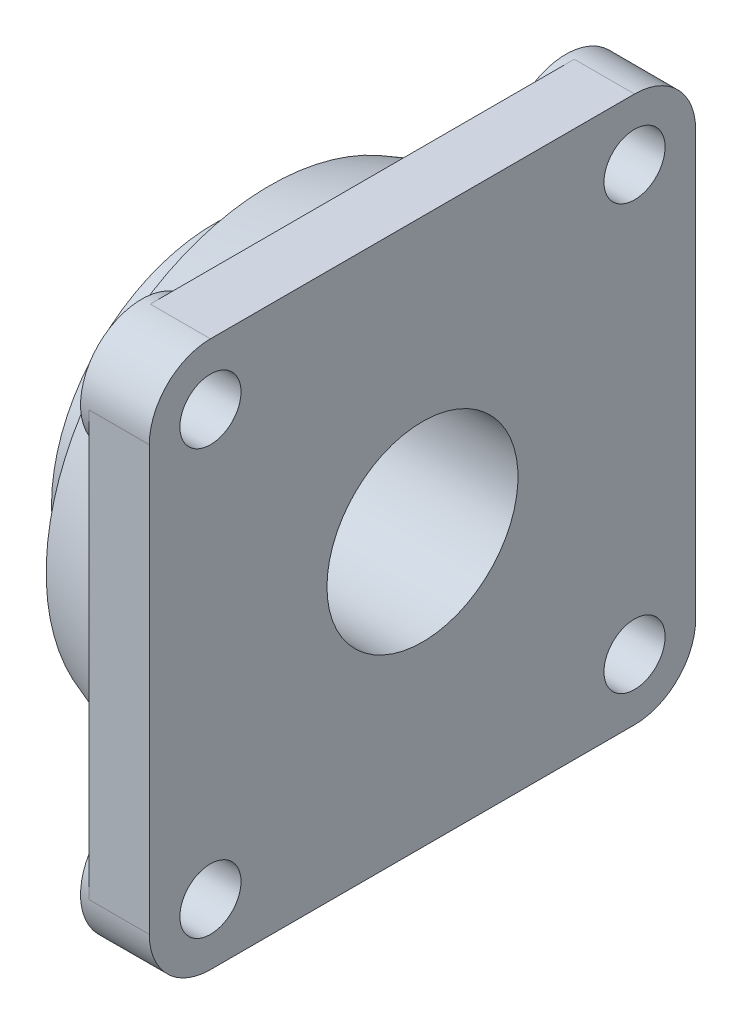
ISO-10303-21;
HEADER;
FILE_DESCRIPTION(('STEP AP214'),'2;1');
FILE_NAME('part.step','',(''),(''),'','','');
FILE_SCHEMA(('AUTOMOTIVE_DESIGN { 1 0 10303 214 1 1 1 1 }'));
ENDSEC;
DATA;
#1=APPLICATION_CONTEXT('core data for automotive mechanical design processes');
#2=APPLICATION_PROTOCOL_DEFINITION('international standard','automotive_design',2000,#1);
#3=PRODUCT_CONTEXT('',#1,'mechanical');
#4=PRODUCT('Part','Part','',(#3));
#5=PRODUCT_RELATED_PRODUCT_CATEGORY('part','',(#4));
#6=PRODUCT_DEFINITION_FORMATION('','',#4);
#7=PRODUCT_DEFINITION_CONTEXT('part definition',#1,'design');
#8=PRODUCT_DEFINITION('design','',#6,#7);
#9=PRODUCT_DEFINITION_SHAPE('','',#8);
#10=(LENGTH_UNIT() NAMED_UNIT(*) SI_UNIT(.MILLI.,.METRE.));
#11=(NAMED_UNIT(*) PLANE_ANGLE_UNIT() SI_UNIT($,.RADIAN.));
#12=(NAMED_UNIT(*) SI_UNIT($,.STERADIAN.) SOLID_ANGLE_UNIT());
#13=UNCERTAINTY_MEASURE_WITH_UNIT(LENGTH_MEASURE(1.E-05),#10,'distance_accuracy_value','');
#14=(GEOMETRIC_REPRESENTATION_CONTEXT(3) GLOBAL_UNCERTAINTY_ASSIGNED_CONTEXT((#13)) GLOBAL_UNIT_ASSIGNED_CONTEXT((#10,
#11,#12)) REPRESENTATION_CONTEXT('',''));
#15=CARTESIAN_POINT('',(0.,0.,0.));
#16=DIRECTION('',(0.,0.,1.));
#17=DIRECTION('',(1.,0.,0.));
#18=AXIS2_PLACEMENT_3D('',#15,#16,#17);
#19=CARTESIAN_POINT('',(-18.,-34.3247858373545,67.7976178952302));
#20=CARTESIAN_POINT('',(-18.,-34.3247858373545,66.6502196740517));
#21=CARTESIAN_POINT('',(-18.,-34.3247858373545,66.4961978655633));
#22=CARTESIAN_POINT('',(-18.,-34.3247858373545,51.0940170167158));
#23=B_SPLINE_CURVE_WITH_KNOTS('',1,(#19,#20,#21,#22),.UNSPECIFIED.,.F.,.F.,(2,1,1,2),
(-0.0844958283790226,-0.01,0.,1.),.UNSPECIFIED.);
#24=DIRECTION('',(0.,1.,0.));
#25=VECTOR('',#24,1.);
#26=SURFACE_OF_LINEAR_EXTRUSION('',#23,#25);
#27=CARTESIAN_POINT('',(-18.,0.,0.));
#28=DIRECTION('',(1.,0.,0.));
#29=DIRECTION('',(0.,0.,-1.));
#30=AXIS2_PLACEMENT_3D('',#27,#28,#29);
#31=CIRCLE('',#30,58.4888527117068);
#32=CARTESIAN_POINT('',(-18.,28.4666000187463,51.0940170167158));
#33=VERTEX_POINT('',#32);
#34=CARTESIAN_POINT('',(-18.,-28.4666000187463,51.0940170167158));
#35=VERTEX_POINT('',#34);
#36=EDGE_CURVE('E20',#33,#35,#31,.T.);
#37=ORIENTED_EDGE('',*,*,#36,.F.);
#38=DIRECTION('',(0.,-0.707106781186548,-0.707106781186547));
#39=VECTOR('',#38,1.);
#40=CARTESIAN_POINT('',(-18.,36.3264457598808,58.9538627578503));
#41=LINE('',#40,#39);
#42=CARTESIAN_POINT('',(-18.,34.3247859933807,56.9522029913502));
#43=VERTEX_POINT('',#42);
#44=EDGE_CURVE('E234',#43,#33,#41,.T.);
#45=ORIENTED_EDGE('',*,*,#44,.F.);
#46=CARTESIAN_POINT('',(-18.,0.,0.));
#47=DIRECTION('',(1.,0.,0.));
#48=DIRECTION('',(0.,0.,-1.));
#49=AXIS2_PLACEMENT_3D('',#46,#47,#48);
#50=CIRCLE('',#49,66.4961978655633);
#51=CARTESIAN_POINT('',(-18.,-34.3247858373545,56.952202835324));
#52=VERTEX_POINT('',#51);
#53=EDGE_CURVE('E213',#52,#43,#50,.F.);
#54=ORIENTED_EDGE('',*,*,#53,.F.);
#55=DIRECTION('',(0.,-0.707106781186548,0.707106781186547));
#56=VECTOR('',#55,1.);
#57=CARTESIAN_POINT('',(-18.,-36.3264457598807,58.9538627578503));
#58=LINE('',#57,#56);
#59=EDGE_CURVE('E211',#35,#52,#58,.T.);
#60=ORIENTED_EDGE('',*,*,#59,.F.);
#61=EDGE_LOOP('',(#37,#45,#54,#60));
#62=FACE_BOUND('',#61,.T.);
#63=ADVANCED_FACE('F16',(#62),#26,.T.);
#64=CARTESIAN_POINT('',(-15.75,0.,0.));
#65=DIRECTION('',(1.,0.,0.));
#66=DIRECTION('',(0.,0.,-1.));
#67=AXIS2_PLACEMENT_3D('',#64,#65,#66);
#68=CYLINDRICAL_SURFACE('',#67,58.4888527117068);
#69=ORIENTED_EDGE('',*,*,#36,.T.);
#70=DIRECTION('',(1.,0.,0.));
#71=VECTOR('',#70,1.);
#72=CARTESIAN_POINT('',(-18.,-28.4666000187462,51.0940170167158));
#73=LINE('',#72,#71);
#74=CARTESIAN_POINT('',(-15.75,-28.4666000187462,51.0940170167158));
#75=VERTEX_POINT('',#74);
#76=EDGE_CURVE('E205',#75,#35,#73,.F.);
#77=ORIENTED_EDGE('',*,*,#76,.F.);
#78=CARTESIAN_POINT('',(-15.75,0.,0.));
#79=DIRECTION('',(1.,0.,0.));
#80=DIRECTION('',(0.,0.,-1.));
#81=AXIS2_PLACEMENT_3D('',#78,#79,#80);
#82=CIRCLE('',#81,58.4888527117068);
#83=CARTESIAN_POINT('',(-15.75,28.4666000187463,51.0940170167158));
#84=VERTEX_POINT('',#83);
#85=EDGE_CURVE('E375',#84,#75,#82,.T.);
#86=ORIENTED_EDGE('',*,*,#85,.F.);
#87=DIRECTION('',(1.,0.,0.));
#88=VECTOR('',#87,1.);
#89=CARTESIAN_POINT('',(-18.,28.4666000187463,51.0940170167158));
#90=LINE('',#89,#88);
#91=EDGE_CURVE('E207',#33,#84,#90,.T.);
#92=ORIENTED_EDGE('',*,*,#91,.F.);
#93=EDGE_LOOP('',(#69,#77,#86,#92));
#94=FACE_BOUND('',#93,.T.);
#95=ADVANCED_FACE('F202',(#94),#68,.T.);
#96=CARTESIAN_POINT('',(-18.,-66.5886109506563,34.3247858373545));
#97=DIRECTION('',(1.,0.,0.));
#98=DIRECTION('',(0.,0.,-1.));
#99=AXIS2_PLACEMENT_3D('',#96,#97,#98);
#100=PLANE('',#99);
#101=DIRECTION('',(0.,0.707106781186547,-0.707106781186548));
#102=VECTOR('',#101,1.);
#103=CARTESIAN_POINT('',(-18.,-58.9538627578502,36.3264457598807));
#104=LINE('',#103,#102);
#105=CARTESIAN_POINT('',(-18.,-56.952202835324,34.3247858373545));
#106=VERTEX_POINT('',#105);
#107=CARTESIAN_POINT('',(-18.,-51.0940170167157,28.4666000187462));
#108=VERTEX_POINT('',#107);
#109=EDGE_CURVE('E415',#106,#108,#104,.T.);
#110=ORIENTED_EDGE('',*,*,#109,.F.);
#111=CARTESIAN_POINT('',(-18.,0.,0.));
#112=DIRECTION('',(1.,0.,0.));
#113=DIRECTION('',(0.,0.,-1.));
#114=AXIS2_PLACEMENT_3D('',#111,#112,#113);
#115=CIRCLE('',#114,66.4961978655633);
#116=CARTESIAN_POINT('',(-18.,-56.952202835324,-34.3247858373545));
#117=VERTEX_POINT('',#116);
#118=EDGE_CURVE('E381',#117,#106,#115,.F.);
#119=ORIENTED_EDGE('',*,*,#118,.F.);
#120=DIRECTION('',(0.,-0.707106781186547,-0.707106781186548));
#121=VECTOR('',#120,1.);
#122=CARTESIAN_POINT('',(-18.,-58.9538627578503,-36.3264457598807));
#123=LINE('',#122,#121);
#124=CARTESIAN_POINT('',(-18.,-51.0940170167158,-28.4666000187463));
#125=VERTEX_POINT('',#124);
#126=EDGE_CURVE('E401',#125,#117,#123,.T.);
#127=ORIENTED_EDGE('',*,*,#126,.F.);
#128=CARTESIAN_POINT('',(-18.,0.,-1.00613961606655E-13));
#129=DIRECTION('',(1.,0.,0.));
#130=DIRECTION('',(0.,0.,-1.));
#131=AXIS2_PLACEMENT_3D('',#128,#129,#130);
#132=CIRCLE('',#131,58.4888527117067);
#133=EDGE_CURVE('E209',#108,#125,#132,.T.);
#134=ORIENTED_EDGE('',*,*,#133,.F.);
#135=EDGE_LOOP('',(#110,#119,#127,#134));
#136=FACE_BOUND('',#135,.T.);
#137=ADVANCED_FACE('F402',(#136),#100,.T.);
#138=CARTESIAN_POINT('',(-15.75,0.,-1.00613961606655E-13));
#139=DIRECTION('',(1.,0.,0.));
#140=DIRECTION('',(0.,0.,-1.));
#141=AXIS2_PLACEMENT_3D('',#138,#139,#140);
#142=CYLINDRICAL_SURFACE('',#141,58.4888527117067);
#143=ORIENTED_EDGE('',*,*,#133,.T.);
#144=DIRECTION('',(1.,0.,0.));
#145=VECTOR('',#144,1.);
#146=CARTESIAN_POINT('',(-18.,-51.0940170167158,-28.4666000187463));
#147=LINE('',#146,#145);
#148=CARTESIAN_POINT('',(-15.75,-51.0940170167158,-28.4666000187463));
#149=VERTEX_POINT('',#148);
#150=EDGE_CURVE('E388',#149,#125,#147,.F.);
#151=ORIENTED_EDGE('',*,*,#150,.F.);
#152=CARTESIAN_POINT('',(-15.75,0.,-1.00613961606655E-13));
#153=DIRECTION('',(1.,0.,0.));
#154=DIRECTION('',(0.,0.,-1.));
#155=AXIS2_PLACEMENT_3D('',#152,#153,#154);
#156=CIRCLE('',#155,58.4888527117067);
#157=CARTESIAN_POINT('',(-15.75,-51.0940170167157,28.4666000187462));
#158=VERTEX_POINT('',#157);
#159=EDGE_CURVE('E367',#158,#149,#156,.T.);
#160=ORIENTED_EDGE('',*,*,#159,.F.);
#161=DIRECTION('',(1.,0.,0.));
#162=VECTOR('',#161,1.);
#163=CARTESIAN_POINT('',(-18.,-51.0940170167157,28.4666000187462));
#164=LINE('',#163,#162);
#165=EDGE_CURVE('E397',#108,#158,#164,.T.);
#166=ORIENTED_EDGE('',*,*,#165,.F.);
#167=EDGE_LOOP('',(#143,#151,#160,#166));
#168=FACE_BOUND('',#167,.T.);
#169=ADVANCED_FACE('F393',(#168),#142,.T.);
#170=CARTESIAN_POINT('',(-18.,-34.3247858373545,-51.0940170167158));
#171=CARTESIAN_POINT('',(-18.,-34.3247858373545,-66.4961978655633));
#172=CARTESIAN_POINT('',(-18.,-34.3247858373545,-66.6502196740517));
#173=CARTESIAN_POINT('',(-18.,-34.3247858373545,-67.7976178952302));
#174=B_SPLINE_CURVE_WITH_KNOTS('',1,(#170,#171,#172,#173),.UNSPECIFIED.,.F.,.F.,(2,1,1,2),(0.,
1.,1.01,1.08449582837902),.UNSPECIFIED.);
#175=DIRECTION('',(0.,1.,0.));
#176=VECTOR('',#175,1.);
#177=SURFACE_OF_LINEAR_EXTRUSION('',#174,#176);
#178=CARTESIAN_POINT('',(-18.,0.,0.));
#179=DIRECTION('',(1.,0.,0.));
#180=DIRECTION('',(0.,0.,-1.));
#181=AXIS2_PLACEMENT_3D('',#178,#179,#180);
#182=CIRCLE('',#181,58.4888527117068);
#183=CARTESIAN_POINT('',(-18.,-28.4666000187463,-51.0940170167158));
#184=VERTEX_POINT('',#183);
#185=CARTESIAN_POINT('',(-18.,28.4666000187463,-51.0940170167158));
#186=VERTEX_POINT('',#185);
#187=EDGE_CURVE('E389',#184,#186,#182,.T.);
#188=ORIENTED_EDGE('',*,*,#187,.F.);
#189=DIRECTION('',(0.,0.707106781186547,0.707106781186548));
#190=VECTOR('',#189,1.);
#191=CARTESIAN_POINT('',(-18.,-36.3264457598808,-58.9538627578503));
#192=LINE('',#191,#190);
#193=CARTESIAN_POINT('',(-18.,-34.324785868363,-56.9522028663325));
#194=VERTEX_POINT('',#193);
#195=EDGE_CURVE('E715',#194,#184,#192,.T.);
#196=ORIENTED_EDGE('',*,*,#195,.F.);
#197=CARTESIAN_POINT('',(-18.,0.,0.));
#198=DIRECTION('',(1.,0.,0.));
#199=DIRECTION('',(0.,0.,-1.));
#200=AXIS2_PLACEMENT_3D('',#197,#198,#199);
#201=CIRCLE('',#200,66.4961978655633);
#202=CARTESIAN_POINT('',(-18.,34.3247858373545,-56.952202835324));
#203=VERTEX_POINT('',#202);
#204=EDGE_CURVE('E217',#203,#194,#201,.F.);
#205=ORIENTED_EDGE('',*,*,#204,.F.);
#206=DIRECTION('',(0.,0.707106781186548,-0.707106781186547));
#207=VECTOR('',#206,1.);
#208=CARTESIAN_POINT('',(-18.,36.3264457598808,-58.9538627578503));
#209=LINE('',#208,#207);
#210=EDGE_CURVE('E524',#186,#203,#209,.T.);
#211=ORIENTED_EDGE('',*,*,#210,.F.);
#212=EDGE_LOOP('',(#188,#196,#205,#211));
#213=FACE_BOUND('',#212,.T.);
#214=ADVANCED_FACE('F730',(#213),#177,.T.);
#215=CARTESIAN_POINT('',(-15.75,0.,0.));
#216=DIRECTION('',(1.,0.,0.));
#217=DIRECTION('',(0.,0.,-1.));
#218=AXIS2_PLACEMENT_3D('',#215,#216,#217);
#219=CYLINDRICAL_SURFACE('',#218,58.4888527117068);
#220=ORIENTED_EDGE('',*,*,#187,.T.);
#221=DIRECTION('',(1.,0.,0.));
#222=VECTOR('',#221,1.);
#223=CARTESIAN_POINT('',(-18.,28.4666000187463,-51.0940170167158));
#224=LINE('',#223,#222);
#225=CARTESIAN_POINT('',(-15.75,28.4666000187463,-51.0940170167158));
#226=VERTEX_POINT('',#225);
#227=EDGE_CURVE('E406',#226,#186,#224,.F.);
#228=ORIENTED_EDGE('',*,*,#227,.F.);
#229=CARTESIAN_POINT('',(-15.75,0.,0.));
#230=DIRECTION('',(1.,0.,0.));
#231=DIRECTION('',(0.,0.,-1.));
#232=AXIS2_PLACEMENT_3D('',#229,#230,#231);
#233=CIRCLE('',#232,58.4888527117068);
#234=CARTESIAN_POINT('',(-15.75,-28.4666000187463,-51.0940170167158));
#235=VERTEX_POINT('',#234);
#236=EDGE_CURVE('E358',#235,#226,#233,.T.);
#237=ORIENTED_EDGE('',*,*,#236,.F.);
#238=DIRECTION('',(1.,0.,0.));
#239=VECTOR('',#238,1.);
#240=CARTESIAN_POINT('',(-18.,-28.4666000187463,-51.0940170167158));
#241=LINE('',#240,#239);
#242=EDGE_CURVE('E558',#184,#235,#241,.T.);
#243=ORIENTED_EDGE('',*,*,#242,.F.);
#244=EDGE_LOOP('',(#220,#228,#237,#243));
#245=FACE_BOUND('',#244,.T.);
#246=ADVANCED_FACE('F701',(#245),#219,.T.);
#247=CARTESIAN_POINT('',(-18.,51.0016039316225,34.3247858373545));
#248=DIRECTION('',(1.,0.,0.));
#249=DIRECTION('',(0.,0.,-1.));
#250=AXIS2_PLACEMENT_3D('',#247,#248,#249);
#251=PLANE('',#250);
#252=DIRECTION('',(0.,-0.707106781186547,0.707106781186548));
#253=VECTOR('',#252,1.);
#254=CARTESIAN_POINT('',(-18.,58.9538627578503,-36.3264457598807));
#255=LINE('',#254,#253);
#256=CARTESIAN_POINT('',(-18.,56.952202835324,-34.3247858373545));
#257=VERTEX_POINT('',#256);
#258=CARTESIAN_POINT('',(-18.,51.0940170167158,-28.4666000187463));
#259=VERTEX_POINT('',#258);
#260=EDGE_CURVE('E527',#257,#259,#255,.T.);
#261=ORIENTED_EDGE('',*,*,#260,.F.);
#262=CARTESIAN_POINT('',(-18.,0.,0.));
#263=DIRECTION('',(1.,0.,0.));
#264=DIRECTION('',(0.,0.,-1.));
#265=AXIS2_PLACEMENT_3D('',#262,#263,#264);
#266=CIRCLE('',#265,66.4961978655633);
#267=CARTESIAN_POINT('',(-18.,56.952202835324,34.3247858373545));
#268=VERTEX_POINT('',#267);
#269=EDGE_CURVE('E377',#268,#257,#266,.F.);
#270=ORIENTED_EDGE('',*,*,#269,.F.);
#271=DIRECTION('',(0.,0.707106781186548,0.707106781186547));
#272=VECTOR('',#271,1.);
#273=CARTESIAN_POINT('',(-18.,58.9538627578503,36.3264457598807));
#274=LINE('',#273,#272);
#275=CARTESIAN_POINT('',(-18.,51.0940170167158,28.4666000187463));
#276=VERTEX_POINT('',#275);
#277=EDGE_CURVE('E223',#276,#268,#274,.T.);
#278=ORIENTED_EDGE('',*,*,#277,.F.);
#279=CARTESIAN_POINT('',(-18.,0.,0.));
#280=DIRECTION('',(1.,0.,0.));
#281=DIRECTION('',(0.,0.,-1.));
#282=AXIS2_PLACEMENT_3D('',#279,#280,#281);
#283=CIRCLE('',#282,58.4888527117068);
#284=EDGE_CURVE('E386',#259,#276,#283,.T.);
#285=ORIENTED_EDGE('',*,*,#284,.F.);
#286=EDGE_LOOP('',(#261,#270,#278,#285));
#287=FACE_BOUND('',#286,.T.);
#288=ADVANCED_FACE('F830',(#287),#251,.T.);
#289=CARTESIAN_POINT('',(-15.75,0.,0.));
#290=DIRECTION('',(1.,0.,0.));
#291=DIRECTION('',(0.,0.,-1.));
#292=AXIS2_PLACEMENT_3D('',#289,#290,#291);
#293=CYLINDRICAL_SURFACE('',#292,58.4888527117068);
#294=ORIENTED_EDGE('',*,*,#284,.T.);
#295=DIRECTION('',(1.,0.,0.));
#296=VECTOR('',#295,1.);
#297=CARTESIAN_POINT('',(-18.,51.0940170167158,28.4666000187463));
#298=LINE('',#297,#296);
#299=CARTESIAN_POINT('',(-15.75,51.0940170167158,28.4666000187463));
#300=VERTEX_POINT('',#299);
#301=EDGE_CURVE('E226',#300,#276,#298,.F.);
#302=ORIENTED_EDGE('',*,*,#301,.F.);
#303=CARTESIAN_POINT('',(-15.75,0.,0.));
#304=DIRECTION('',(1.,0.,0.));
#305=DIRECTION('',(0.,0.,-1.));
#306=AXIS2_PLACEMENT_3D('',#303,#304,#305);
#307=CIRCLE('',#306,58.4888527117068);
#308=CARTESIAN_POINT('',(-15.75,51.0940170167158,-28.4666000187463));
#309=VERTEX_POINT('',#308);
#310=EDGE_CURVE('E349',#309,#300,#307,.T.);
#311=ORIENTED_EDGE('',*,*,#310,.F.);
#312=DIRECTION('',(1.,0.,0.));
#313=VECTOR('',#312,1.);
#314=CARTESIAN_POINT('',(-18.,51.0940170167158,-28.4666000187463));
#315=LINE('',#314,#313);
#316=EDGE_CURVE('E525',#259,#309,#315,.T.);
#317=ORIENTED_EDGE('',*,*,#316,.F.);
#318=EDGE_LOOP('',(#294,#302,#311,#317));
#319=FACE_BOUND('',#318,.T.);
#320=ADVANCED_FACE('F828',(#319),#293,.T.);
#321=CARTESIAN_POINT('',(-18.,-51.0940170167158,-28.4666000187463));
#322=DIRECTION('',(0.,-0.707106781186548,0.707106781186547));
#323=DIRECTION('',(0.,-0.707106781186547,-0.707106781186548));
#324=AXIS2_PLACEMENT_3D('',#321,#322,#323);
#325=PLANE('',#324);
#326=CARTESIAN_POINT('',(-18.,-66.8137084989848,-44.1862915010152));
#327=CARTESIAN_POINT('',(-18.,-66.4028124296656,-43.775395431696));
#328=CARTESIAN_POINT('',(-18.,-65.9919163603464,-43.3644993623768));
#329=CARTESIAN_POINT('',(-18.,-65.170124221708,-42.5427072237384));
#330=CARTESIAN_POINT('',(-18.,-64.7592281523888,-42.1318111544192));
#331=CARTESIAN_POINT('',(-18.,-63.9374360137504,-41.3100190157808));
#332=CARTESIAN_POINT('',(-18.,-63.5265399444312,-40.8991229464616));
#333=CARTESIAN_POINT('',(-18.,-62.7047478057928,-40.0773308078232));
#334=CARTESIAN_POINT('',(-18.,-62.2938517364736,-39.666434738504));
#335=CARTESIAN_POINT('',(-18.,-61.4720595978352,-38.8446425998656));
#336=CARTESIAN_POINT('',(-18.,-61.061163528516,-38.4337465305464));
#337=CARTESIAN_POINT('',(-18.,-60.2393713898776,-37.611954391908));
#338=CARTESIAN_POINT('',(-18.,-59.8284753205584,-37.2010583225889));
#339=CARTESIAN_POINT('',(-18.,-59.00668318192,-36.3792661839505));
#340=CARTESIAN_POINT('',(-18.,-58.5957871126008,-35.9683701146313));
#341=CARTESIAN_POINT('',(-18.,-57.7739949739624,-35.1465779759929));
#342=CARTESIAN_POINT('',(-18.,-57.3630989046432,-34.7356819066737));
#343=CARTESIAN_POINT('',(-18.,-56.952202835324,-34.3247858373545));
#344=B_SPLINE_CURVE_WITH_KNOTS('',3,(#326,#327,#328,#329,#330,#331,#332,#333,#334,#335,#336,
#337,#338,#339,#340,#341,#342,#343),.UNSPECIFIED.,.F.,.F.,(4,2,2,2,2,2,2,2,4),(0.,
1.74328438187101,3.48656876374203,5.22985314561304,6.97313752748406,8.71642190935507,
10.4597062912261,12.2029906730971,13.9462750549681),.UNSPECIFIED.);
#345=CARTESIAN_POINT('',(-18.,-66.8137084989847,-44.1862915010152));
#346=VERTEX_POINT('',#345);
#347=EDGE_CURVE('E345',#346,#117,#344,.T.);
#348=ORIENTED_EDGE('',*,*,#347,.F.);
#349=DIRECTION('',(-1.,0.,0.));
#350=VECTOR('',#349,1.);
#351=CARTESIAN_POINT('',(-16.875,-66.8137084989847,-44.1862915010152));
#352=LINE('',#351,#350);
#353=CARTESIAN_POINT('',(-15.75,-66.8137084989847,-44.1862915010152));
#354=VERTEX_POINT('',#353);
#355=EDGE_CURVE('E365',#354,#346,#352,.T.);
#356=ORIENTED_EDGE('',*,*,#355,.F.);
#357=CARTESIAN_POINT('',(-15.75,-51.0940170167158,-28.4666000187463));
#358=CARTESIAN_POINT('',(-15.75,-51.7490041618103,-29.1215871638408));
#359=CARTESIAN_POINT('',(-15.75,-52.4039913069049,-29.7765743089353));
#360=CARTESIAN_POINT('',(-15.75,-53.713965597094,-31.0865485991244));
#361=CARTESIAN_POINT('',(-15.75,-54.3689527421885,-31.741535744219));
#362=CARTESIAN_POINT('',(-15.75,-55.6789270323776,-33.051510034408));
#363=CARTESIAN_POINT('',(-15.75,-56.3339141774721,-33.7064971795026));
#364=CARTESIAN_POINT('',(-15.75,-57.6438884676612,-35.0164714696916));
#365=CARTESIAN_POINT('',(-15.75,-58.2988756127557,-35.6714586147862));
#366=CARTESIAN_POINT('',(-15.75,-59.6088499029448,-36.9814329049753));
#367=CARTESIAN_POINT('',(-15.75,-60.2638370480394,-37.6364200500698));
#368=CARTESIAN_POINT('',(-15.75,-61.5738113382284,-38.9463943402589));
#369=CARTESIAN_POINT('',(-15.75,-62.228798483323,-39.6013814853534));
#370=CARTESIAN_POINT('',(-15.75,-63.5387727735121,-40.9113557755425));
#371=CARTESIAN_POINT('',(-15.75,-64.1937599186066,-41.5663429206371));
#372=CARTESIAN_POINT('',(-15.75,-65.5037342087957,-42.8763172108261));
#373=CARTESIAN_POINT('',(-15.75,-66.1587213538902,-43.5313043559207));
#374=CARTESIAN_POINT('',(-15.75,-66.8137084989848,-44.1862915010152));
#375=B_SPLINE_CURVE_WITH_KNOTS('',3,(#357,#358,#359,#360,#361,#362,#363,#364,#365,#366,#367,
#368,#369,#370,#371,#372,#373,#374),.UNSPECIFIED.,.F.,.F.,(4,2,2,2,2,2,2,2,4),(0.,
2.7788751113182,5.5577502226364,8.33662533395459,11.1155004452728,13.894375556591,
16.6732506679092,19.4521257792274,22.2310008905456),.UNSPECIFIED.);
#376=EDGE_CURVE('E366',#149,#354,#375,.T.);
#377=ORIENTED_EDGE('',*,*,#376,.F.);
#378=ORIENTED_EDGE('',*,*,#150,.T.);
#379=ORIENTED_EDGE('',*,*,#126,.T.);
#380=EDGE_LOOP('',(#348,#356,#377,#378,#379));
#381=FACE_BOUND('',#380,.T.);
#382=ADVANCED_FACE('F408',(#381),#325,.T.);
#383=CARTESIAN_POINT('',(-18.,28.4666000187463,-51.0940170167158));
#384=DIRECTION('',(0.,-0.707106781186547,-0.707106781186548));
#385=DIRECTION('',(0.,0.707106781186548,-0.707106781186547));
#386=AXIS2_PLACEMENT_3D('',#383,#384,#385);
#387=PLANE('',#386);
#388=CARTESIAN_POINT('',(-18.,44.1862915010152,-66.8137084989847));
#389=CARTESIAN_POINT('',(-18.,43.775395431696,-66.4028124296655));
#390=CARTESIAN_POINT('',(-18.,43.3644993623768,-65.9919163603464));
#391=CARTESIAN_POINT('',(-18.,42.5427072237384,-65.170124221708));
#392=CARTESIAN_POINT('',(-18.,42.1318111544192,-64.7592281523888));
#393=CARTESIAN_POINT('',(-18.,41.3100190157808,-63.9374360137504));
#394=CARTESIAN_POINT('',(-18.,40.8991229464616,-63.5265399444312));
#395=CARTESIAN_POINT('',(-18.,40.0773308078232,-62.7047478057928));
#396=CARTESIAN_POINT('',(-18.,39.666434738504,-62.2938517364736));
#397=CARTESIAN_POINT('',(-18.,38.8446425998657,-61.4720595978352));
#398=CARTESIAN_POINT('',(-18.,38.4337465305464,-61.061163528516));
#399=CARTESIAN_POINT('',(-18.,37.611954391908,-60.2393713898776));
#400=CARTESIAN_POINT('',(-18.,37.2010583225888,-59.8284753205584));
#401=CARTESIAN_POINT('',(-18.,36.3792661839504,-59.00668318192));
#402=CARTESIAN_POINT('',(-18.,35.9683701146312,-58.5957871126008));
#403=CARTESIAN_POINT('',(-18.,35.1465779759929,-57.7739949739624));
#404=CARTESIAN_POINT('',(-18.,34.7356819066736,-57.3630989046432));
#405=CARTESIAN_POINT('',(-18.,34.3247858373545,-56.952202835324));
#406=B_SPLINE_CURVE_WITH_KNOTS('',3,(#388,#389,#390,#391,#392,#393,#394,#395,#396,#397,#398,
#399,#400,#401,#402,#403,#404,#405),.UNSPECIFIED.,.F.,.F.,(4,2,2,2,2,2,2,2,4),(0.,
1.74328438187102,3.48656876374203,5.22985314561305,6.97313752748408,8.71642190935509,
10.4597062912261,12.2029906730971,13.9462750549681),.UNSPECIFIED.);
#407=CARTESIAN_POINT('',(-18.,44.1862915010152,-66.8137084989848));
#408=VERTEX_POINT('',#407);
#409=EDGE_CURVE('E340',#408,#203,#406,.T.);
#410=ORIENTED_EDGE('',*,*,#409,.F.);
#411=DIRECTION('',(-1.,0.,0.));
#412=VECTOR('',#411,1.);
#413=CARTESIAN_POINT('',(-16.875,44.1862915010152,-66.8137084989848));
#414=LINE('',#413,#412);
#415=CARTESIAN_POINT('',(-15.75,44.1862915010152,-66.8137084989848));
#416=VERTEX_POINT('',#415);
#417=EDGE_CURVE('E356',#416,#408,#414,.T.);
#418=ORIENTED_EDGE('',*,*,#417,.F.);
#419=CARTESIAN_POINT('',(-15.75,28.4666000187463,-51.0940170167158));
#420=CARTESIAN_POINT('',(-15.75,29.1215871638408,-51.7490041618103));
#421=CARTESIAN_POINT('',(-15.75,29.7765743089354,-52.4039913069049));
#422=CARTESIAN_POINT('',(-15.75,31.0865485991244,-53.713965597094));
#423=CARTESIAN_POINT('',(-15.75,31.741535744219,-54.3689527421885));
#424=CARTESIAN_POINT('',(-15.75,33.0515100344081,-55.6789270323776));
#425=CARTESIAN_POINT('',(-15.75,33.7064971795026,-56.3339141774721));
#426=CARTESIAN_POINT('',(-15.75,35.0164714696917,-57.6438884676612));
#427=CARTESIAN_POINT('',(-15.75,35.6714586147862,-58.2988756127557));
#428=CARTESIAN_POINT('',(-15.75,36.9814329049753,-59.6088499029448));
#429=CARTESIAN_POINT('',(-15.75,37.6364200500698,-60.2638370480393));
#430=CARTESIAN_POINT('',(-15.75,38.9463943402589,-61.5738113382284));
#431=CARTESIAN_POINT('',(-15.75,39.6013814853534,-62.228798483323));
#432=CARTESIAN_POINT('',(-15.75,40.9113557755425,-63.5387727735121));
#433=CARTESIAN_POINT('',(-15.75,41.5663429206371,-64.1937599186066));
#434=CARTESIAN_POINT('',(-15.75,42.8763172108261,-65.5037342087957));
#435=CARTESIAN_POINT('',(-15.75,43.5313043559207,-66.1587213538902));
#436=CARTESIAN_POINT('',(-15.75,44.1862915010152,-66.8137084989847));
#437=B_SPLINE_CURVE_WITH_KNOTS('',3,(#419,#420,#421,#422,#423,#424,#425,#426,#427,#428,#429,
#430,#431,#432,#433,#434,#435,#436),.UNSPECIFIED.,.F.,.F.,(4,2,2,2,2,2,2,2,4),(0.,
2.77887511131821,5.55775022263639,8.33662533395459,11.1155004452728,13.894375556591,
16.6732506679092,19.4521257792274,22.2310008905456),.UNSPECIFIED.);
#438=EDGE_CURVE('E357',#226,#416,#437,.T.);
#439=ORIENTED_EDGE('',*,*,#438,.F.);
#440=ORIENTED_EDGE('',*,*,#227,.T.);
#441=ORIENTED_EDGE('',*,*,#210,.T.);
#442=EDGE_LOOP('',(#410,#418,#439,#440,#441));
#443=FACE_BOUND('',#442,.T.);
#444=ADVANCED_FACE('F707',(#443),#387,.T.);
#445=CARTESIAN_POINT('',(-18.,51.0940170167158,28.4666000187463));
#446=DIRECTION('',(0.,0.707106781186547,-0.707106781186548));
#447=DIRECTION('',(0.,0.707106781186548,0.707106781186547));
#448=AXIS2_PLACEMENT_3D('',#445,#446,#447);
#449=PLANE('',#448);
#450=CARTESIAN_POINT('',(-18.,66.8137084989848,44.1862915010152));
#451=CARTESIAN_POINT('',(-18.,66.4028124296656,43.775395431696));
#452=CARTESIAN_POINT('',(-18.,65.9919163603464,43.3644993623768));
#453=CARTESIAN_POINT('',(-18.,65.170124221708,42.5427072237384));
#454=CARTESIAN_POINT('',(-18.,64.7592281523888,42.1318111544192));
#455=CARTESIAN_POINT('',(-18.,63.9374360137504,41.3100190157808));
#456=CARTESIAN_POINT('',(-18.,63.5265399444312,40.8991229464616));
#457=CARTESIAN_POINT('',(-18.,62.7047478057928,40.0773308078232));
#458=CARTESIAN_POINT('',(-18.,62.2938517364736,39.666434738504));
#459=CARTESIAN_POINT('',(-18.,61.4720595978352,38.8446425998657));
#460=CARTESIAN_POINT('',(-18.,61.061163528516,38.4337465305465));
#461=CARTESIAN_POINT('',(-18.,60.2393713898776,37.6119543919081));
#462=CARTESIAN_POINT('',(-18.,59.8284753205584,37.2010583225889));
#463=CARTESIAN_POINT('',(-18.,59.00668318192,36.3792661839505));
#464=CARTESIAN_POINT('',(-18.,58.5957871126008,35.9683701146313));
#465=CARTESIAN_POINT('',(-18.,57.7739949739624,35.1465779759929));
#466=CARTESIAN_POINT('',(-18.,57.3630989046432,34.7356819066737));
#467=CARTESIAN_POINT('',(-18.,56.952202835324,34.3247858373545));
#468=B_SPLINE_CURVE_WITH_KNOTS('',3,(#450,#451,#452,#453,#454,#455,#456,#457,#458,#459,#460,
#461,#462,#463,#464,#465,#466,#467),.UNSPECIFIED.,.F.,.F.,(4,2,2,2,2,2,2,2,4),(0.,
1.74328438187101,3.48656876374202,5.22985314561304,6.97313752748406,8.71642190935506,
10.4597062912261,12.2029906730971,13.9462750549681),.UNSPECIFIED.);
#469=CARTESIAN_POINT('',(-18.,66.8137084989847,44.1862915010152));
#470=VERTEX_POINT('',#469);
#471=EDGE_CURVE('E335',#470,#268,#468,.T.);
#472=ORIENTED_EDGE('',*,*,#471,.F.);
#473=DIRECTION('',(-1.,0.,0.));
#474=VECTOR('',#473,1.);
#475=CARTESIAN_POINT('',(-16.875,66.8137084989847,44.1862915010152));
#476=LINE('',#475,#474);
#477=CARTESIAN_POINT('',(-15.75,66.8137084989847,44.1862915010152));
#478=VERTEX_POINT('',#477);
#479=EDGE_CURVE('E379',#478,#470,#476,.T.);
#480=ORIENTED_EDGE('',*,*,#479,.F.);
#481=CARTESIAN_POINT('',(-15.75,51.0940170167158,28.4666000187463));
#482=CARTESIAN_POINT('',(-15.75,51.7490041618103,29.1215871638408));
#483=CARTESIAN_POINT('',(-15.75,52.4039913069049,29.7765743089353));
#484=CARTESIAN_POINT('',(-15.75,53.713965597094,31.0865485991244));
#485=CARTESIAN_POINT('',(-15.75,54.3689527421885,31.741535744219));
#486=CARTESIAN_POINT('',(-15.75,55.6789270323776,33.051510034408));
#487=CARTESIAN_POINT('',(-15.75,56.3339141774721,33.7064971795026));
#488=CARTESIAN_POINT('',(-15.75,57.6438884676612,35.0164714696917));
#489=CARTESIAN_POINT('',(-15.75,58.2988756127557,35.6714586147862));
#490=CARTESIAN_POINT('',(-15.75,59.6088499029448,36.9814329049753));
#491=CARTESIAN_POINT('',(-15.75,60.2638370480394,37.6364200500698));
#492=CARTESIAN_POINT('',(-15.75,61.5738113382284,38.9463943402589));
#493=CARTESIAN_POINT('',(-15.75,62.228798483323,39.6013814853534));
#494=CARTESIAN_POINT('',(-15.75,63.5387727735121,40.9113557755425));
#495=CARTESIAN_POINT('',(-15.75,64.1937599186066,41.5663429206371));
#496=CARTESIAN_POINT('',(-15.75,65.5037342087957,42.8763172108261));
#497=CARTESIAN_POINT('',(-15.75,66.1587213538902,43.5313043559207));
#498=CARTESIAN_POINT('',(-15.75,66.8137084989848,44.1862915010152));
#499=B_SPLINE_CURVE_WITH_KNOTS('',3,(#481,#482,#483,#484,#485,#486,#487,#488,#489,#490,#491,
#492,#493,#494,#495,#496,#497,#498),.UNSPECIFIED.,.F.,.F.,(4,2,2,2,2,2,2,2,4),(0.,
2.77887511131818,5.55775022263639,8.33662533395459,11.1155004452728,13.894375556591,
16.6732506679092,19.4521257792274,22.2310008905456),.UNSPECIFIED.);
#500=EDGE_CURVE('E348',#300,#478,#499,.T.);
#501=ORIENTED_EDGE('',*,*,#500,.F.);
#502=ORIENTED_EDGE('',*,*,#301,.T.);
#503=ORIENTED_EDGE('',*,*,#277,.T.);
#504=EDGE_LOOP('',(#472,#480,#501,#502,#503));
#505=FACE_BOUND('',#504,.T.);
#506=ADVANCED_FACE('F635',(#505),#449,.T.);
#507=CARTESIAN_POINT('',(-18.,-28.4666000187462,51.0940170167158));
#508=DIRECTION('',(0.,0.707106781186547,0.707106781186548));
#509=DIRECTION('',(0.,-0.707106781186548,0.707106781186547));
#510=AXIS2_PLACEMENT_3D('',#507,#508,#509);
#511=PLANE('',#510);
#512=CARTESIAN_POINT('',(-18.,-44.1862915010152,66.8137084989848));
#513=CARTESIAN_POINT('',(-18.,-43.775395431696,66.4028124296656));
#514=CARTESIAN_POINT('',(-18.,-43.3644993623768,65.9919163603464));
#515=CARTESIAN_POINT('',(-18.,-42.5427072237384,65.170124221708));
#516=CARTESIAN_POINT('',(-18.,-42.1318111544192,64.7592281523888));
#517=CARTESIAN_POINT('',(-18.,-41.3100190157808,63.9374360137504));
#518=CARTESIAN_POINT('',(-18.,-40.8991229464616,63.5265399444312));
#519=CARTESIAN_POINT('',(-18.,-40.0773308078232,62.7047478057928));
#520=CARTESIAN_POINT('',(-18.,-39.666434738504,62.2938517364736));
#521=CARTESIAN_POINT('',(-18.,-38.8446425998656,61.4720595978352));
#522=CARTESIAN_POINT('',(-18.,-38.4337465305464,61.061163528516));
#523=CARTESIAN_POINT('',(-18.,-37.611954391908,60.2393713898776));
#524=CARTESIAN_POINT('',(-18.,-37.2010583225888,59.8284753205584));
#525=CARTESIAN_POINT('',(-18.,-36.3792661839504,59.00668318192));
#526=CARTESIAN_POINT('',(-18.,-35.9683701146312,58.5957871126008));
#527=CARTESIAN_POINT('',(-18.,-35.1465779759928,57.7739949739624));
#528=CARTESIAN_POINT('',(-18.,-34.7356819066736,57.3630989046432));
#529=CARTESIAN_POINT('',(-18.,-34.3247858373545,56.952202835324));
#530=B_SPLINE_CURVE_WITH_KNOTS('',3,(#512,#513,#514,#515,#516,#517,#518,#519,#520,#521,#522,
#523,#524,#525,#526,#527,#528,#529),.UNSPECIFIED.,.F.,.F.,(4,2,2,2,2,2,2,2,4),(0.,
1.74328438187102,3.48656876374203,5.22985314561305,6.97313752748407,8.71642190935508,
10.4597062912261,12.2029906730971,13.9462750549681),.UNSPECIFIED.);
#531=CARTESIAN_POINT('',(-18.,-44.1862915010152,66.8137084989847));
#532=VERTEX_POINT('',#531);
#533=EDGE_CURVE('E331',#532,#52,#530,.T.);
#534=ORIENTED_EDGE('',*,*,#533,.F.);
#535=DIRECTION('',(-1.,0.,0.));
#536=VECTOR('',#535,1.);
#537=CARTESIAN_POINT('',(-16.875,-44.1862915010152,66.8137084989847));
#538=LINE('',#537,#536);
#539=CARTESIAN_POINT('',(-15.75,-44.1862915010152,66.8137084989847));
#540=VERTEX_POINT('',#539);
#541=EDGE_CURVE('E374',#540,#532,#538,.T.);
#542=ORIENTED_EDGE('',*,*,#541,.F.);
#543=CARTESIAN_POINT('',(-15.75,-28.4666000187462,51.0940170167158));
#544=CARTESIAN_POINT('',(-15.75,-29.1215871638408,51.7490041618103));
#545=CARTESIAN_POINT('',(-15.75,-29.7765743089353,52.4039913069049));
#546=CARTESIAN_POINT('',(-15.75,-31.0865485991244,53.7139655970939));
#547=CARTESIAN_POINT('',(-15.75,-31.7415357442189,54.3689527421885));
#548=CARTESIAN_POINT('',(-15.75,-33.051510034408,55.6789270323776));
#549=CARTESIAN_POINT('',(-15.75,-33.7064971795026,56.3339141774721));
#550=CARTESIAN_POINT('',(-15.75,-35.0164714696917,57.6438884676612));
#551=CARTESIAN_POINT('',(-15.75,-35.6714586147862,58.2988756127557));
#552=CARTESIAN_POINT('',(-15.75,-36.9814329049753,59.6088499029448));
#553=CARTESIAN_POINT('',(-15.75,-37.6364200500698,60.2638370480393));
#554=CARTESIAN_POINT('',(-15.75,-38.9463943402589,61.5738113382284));
#555=CARTESIAN_POINT('',(-15.75,-39.6013814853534,62.228798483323));
#556=CARTESIAN_POINT('',(-15.75,-40.9113557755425,63.5387727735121));
#557=CARTESIAN_POINT('',(-15.75,-41.5663429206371,64.1937599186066));
#558=CARTESIAN_POINT('',(-15.75,-42.8763172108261,65.5037342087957));
#559=CARTESIAN_POINT('',(-15.75,-43.5313043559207,66.1587213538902));
#560=CARTESIAN_POINT('',(-15.75,-44.1862915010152,66.8137084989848));
#561=B_SPLINE_CURVE_WITH_KNOTS('',3,(#543,#544,#545,#546,#547,#548,#549,#550,#551,#552,#553,
#554,#555,#556,#557,#558,#559,#560),.UNSPECIFIED.,.F.,.F.,(4,2,2,2,2,2,2,2,4),(0.,
2.7788751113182,5.5577502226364,8.3366253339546,11.1155004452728,13.894375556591,
16.6732506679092,19.4521257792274,22.2310008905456),.UNSPECIFIED.);
#562=EDGE_CURVE('E221',#75,#540,#561,.T.);
#563=ORIENTED_EDGE('',*,*,#562,.F.);
#564=ORIENTED_EDGE('',*,*,#76,.T.);
#565=ORIENTED_EDGE('',*,*,#59,.T.);
#566=EDGE_LOOP('',(#534,#542,#563,#564,#565));
#567=FACE_BOUND('',#566,.T.);
#568=ADVANCED_FACE('F219',(#567),#511,.T.);
#569=CARTESIAN_POINT('',(-40.,0.,0.));
#570=DIRECTION('',(1.,0.,0.));
#571=DIRECTION('',(0.,0.,-1.));
#572=AXIS2_PLACEMENT_3D('',#569,#570,#571);
#573=CONICAL_SURFACE('',#572,58.4888527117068,0.349065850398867);
#574=CARTESIAN_POINT('',(-40.,0.,0.));
#575=DIRECTION('',(1.,0.,0.));
#576=DIRECTION('',(0.,0.,-1.));
#577=AXIS2_PLACEMENT_3D('',#574,#575,#576);
#578=CIRCLE('',#577,58.4888527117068);
#579=CARTESIAN_POINT('',(-40.,0.,-58.4888527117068));
#580=VERTEX_POINT('',#579);
#581=EDGE_CURVE('E324',#580,#580,#578,.F.);
#582=ORIENTED_EDGE('',*,*,#581,.F.);
#583=EDGE_LOOP('',(#582));
#584=FACE_BOUND('',#583,.T.);
#585=CARTESIAN_POINT('',(-18.,0.,0.));
#586=DIRECTION('',(1.,0.,0.));
#587=DIRECTION('',(0.,0.,-1.));
#588=AXIS2_PLACEMENT_3D('',#585,#586,#587);
#589=CIRCLE('',#588,66.4961978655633);
#590=EDGE_CURVE('E332',#268,#43,#589,.T.);
#591=ORIENTED_EDGE('',*,*,#590,.F.);
#592=ORIENTED_EDGE('',*,*,#269,.T.);
#593=CARTESIAN_POINT('',(-18.,0.,0.));
#594=DIRECTION('',(1.,0.,0.));
#595=DIRECTION('',(0.,0.,-1.));
#596=AXIS2_PLACEMENT_3D('',#593,#594,#595);
#597=CIRCLE('',#596,66.4961978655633);
#598=EDGE_CURVE('E336',#203,#257,#597,.T.);
#599=ORIENTED_EDGE('',*,*,#598,.F.);
#600=ORIENTED_EDGE('',*,*,#204,.T.);
#601=CARTESIAN_POINT('',(-18.,0.,0.));
#602=DIRECTION('',(1.,0.,0.));
#603=DIRECTION('',(0.,0.,-1.));
#604=AXIS2_PLACEMENT_3D('',#601,#602,#603);
#605=CIRCLE('',#604,66.4961978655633);
#606=EDGE_CURVE('E341',#117,#194,#605,.T.);
#607=ORIENTED_EDGE('',*,*,#606,.F.);
#608=ORIENTED_EDGE('',*,*,#118,.T.);
#609=CARTESIAN_POINT('',(-18.,0.,0.));
#610=DIRECTION('',(1.,0.,0.));
#611=DIRECTION('',(0.,0.,-1.));
#612=AXIS2_PLACEMENT_3D('',#609,#610,#611);
#613=CIRCLE('',#612,66.4961978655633);
#614=EDGE_CURVE('E328',#52,#106,#613,.T.);
#615=ORIENTED_EDGE('',*,*,#614,.F.);
#616=ORIENTED_EDGE('',*,*,#53,.T.);
#617=EDGE_LOOP('',(#591,#592,#599,#600,#607,#608,#615,#616));
#618=FACE_BOUND('',#617,.T.);
#619=ADVANCED_FACE('F639',(#584,#618),#573,.T.);
#620=CARTESIAN_POINT('',(-18.,44.1862915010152,66.8137084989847));
#621=DIRECTION('',(0.,-0.707106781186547,0.707106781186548));
#622=DIRECTION('',(0.,-0.707106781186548,-0.707106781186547));
#623=AXIS2_PLACEMENT_3D('',#620,#621,#622);
#624=PLANE('',#623);
#625=ORIENTED_EDGE('',*,*,#44,.T.);
#626=ORIENTED_EDGE('',*,*,#91,.T.);
#627=CARTESIAN_POINT('',(-15.75,44.1862915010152,66.8137084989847));
#628=CARTESIAN_POINT('',(-15.75,43.5313043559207,66.1587213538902));
#629=CARTESIAN_POINT('',(-15.75,42.8763172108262,65.5037342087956));
#630=CARTESIAN_POINT('',(-15.75,41.5663429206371,64.1937599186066));
#631=CARTESIAN_POINT('',(-15.75,40.9113557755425,63.538772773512));
#632=CARTESIAN_POINT('',(-15.75,39.6013814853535,62.228798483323));
#633=CARTESIAN_POINT('',(-15.75,38.9463943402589,61.5738113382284));
#634=CARTESIAN_POINT('',(-15.75,37.6364200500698,60.2638370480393));
#635=CARTESIAN_POINT('',(-15.75,36.9814329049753,59.6088499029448));
#636=CARTESIAN_POINT('',(-15.75,35.6714586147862,58.2988756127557));
#637=CARTESIAN_POINT('',(-15.75,35.0164714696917,57.6438884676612));
#638=CARTESIAN_POINT('',(-15.75,33.7064971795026,56.3339141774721));
#639=CARTESIAN_POINT('',(-15.75,33.0515100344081,55.6789270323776));
#640=CARTESIAN_POINT('',(-15.75,31.741535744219,54.3689527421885));
#641=CARTESIAN_POINT('',(-15.75,31.0865485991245,53.7139655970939));
#642=CARTESIAN_POINT('',(-15.75,29.7765743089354,52.4039913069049));
#643=CARTESIAN_POINT('',(-15.75,29.1215871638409,51.7490041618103));
#644=CARTESIAN_POINT('',(-15.75,28.4666000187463,51.0940170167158));
#645=B_SPLINE_CURVE_WITH_KNOTS('',3,(#627,#628,#629,#630,#631,#632,#633,#634,#635,#636,#637,
#638,#639,#640,#641,#642,#643,#644),.UNSPECIFIED.,.F.,.F.,(4,2,2,2,2,2,2,2,4),(0.,
2.7788751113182,5.55775022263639,8.33662533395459,11.1155004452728,13.894375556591,
16.6732506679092,19.4521257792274,22.2310008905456),.UNSPECIFIED.);
#646=CARTESIAN_POINT('',(-15.75,44.1862915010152,66.8137084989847));
#647=VERTEX_POINT('',#646);
#648=EDGE_CURVE('E233',#647,#84,#645,.T.);
#649=ORIENTED_EDGE('',*,*,#648,.F.);
#650=DIRECTION('',(1.,0.,0.));
#651=VECTOR('',#650,1.);
#652=CARTESIAN_POINT('',(-9.,44.1862915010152,66.8137084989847));
#653=LINE('',#652,#651);
#654=CARTESIAN_POINT('',(-18.,44.1862915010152,66.8137084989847));
#655=VERTEX_POINT('',#654);
#656=EDGE_CURVE('E320',#655,#647,#653,.T.);
#657=ORIENTED_EDGE('',*,*,#656,.F.);
#658=CARTESIAN_POINT('',(-18.,34.3247858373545,56.952202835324));
#659=CARTESIAN_POINT('',(-18.,34.7356819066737,57.3630989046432));
#660=CARTESIAN_POINT('',(-18.,35.1465779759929,57.7739949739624));
#661=CARTESIAN_POINT('',(-18.,35.9683701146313,58.5957871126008));
#662=CARTESIAN_POINT('',(-18.,36.3792661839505,59.00668318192));
#663=CARTESIAN_POINT('',(-18.,37.2010583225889,59.8284753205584));
#664=CARTESIAN_POINT('',(-18.,37.6119543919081,60.2393713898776));
#665=CARTESIAN_POINT('',(-18.,38.4337465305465,61.061163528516));
#666=CARTESIAN_POINT('',(-18.,38.8446425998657,61.4720595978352));
#667=CARTESIAN_POINT('',(-18.,39.6664347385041,62.2938517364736));
#668=CARTESIAN_POINT('',(-18.,40.0773308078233,62.7047478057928));
#669=CARTESIAN_POINT('',(-18.,40.8991229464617,63.5265399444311));
#670=CARTESIAN_POINT('',(-18.,41.3100190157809,63.9374360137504));
#671=CARTESIAN_POINT('',(-18.,42.1318111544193,64.7592281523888));
#672=CARTESIAN_POINT('',(-18.,42.5427072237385,65.170124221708));
#673=CARTESIAN_POINT('',(-18.,43.3644993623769,65.9919163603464));
#674=CARTESIAN_POINT('',(-18.,43.7753954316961,66.4028124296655));
#675=CARTESIAN_POINT('',(-18.,44.1862915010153,66.8137084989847));
#676=B_SPLINE_CURVE_WITH_KNOTS('',3,(#658,#659,#660,#661,#662,#663,#664,#665,#666,#667,#668,
#669,#670,#671,#672,#673,#674,#675),.UNSPECIFIED.,.F.,.F.,(4,2,2,2,2,2,2,2,4),(0.,
1.74328438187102,3.48656876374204,5.22985314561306,6.97313752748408,8.71642190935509,
10.4597062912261,12.2029906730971,13.9462750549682),.UNSPECIFIED.);
#677=EDGE_CURVE('E339',#43,#655,#676,.T.);
#678=ORIENTED_EDGE('',*,*,#677,.F.);
#679=EDGE_LOOP('',(#625,#626,#649,#657,#678));
#680=FACE_BOUND('',#679,.T.);
#681=ADVANCED_FACE('F626',(#680),#624,.T.);
#682=CARTESIAN_POINT('',(-15.75,-56.166,51.0940170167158));
#683=DIRECTION('',(-1.,0.,0.));
#684=DIRECTION('',(0.,0.,1.));
#685=AXIS2_PLACEMENT_3D('',#682,#683,#684);
#686=PLANE('',#685);
#687=ORIENTED_EDGE('',*,*,#562,.T.);
#688=CARTESIAN_POINT('',(-15.75,-55.5,55.5));
#689=DIRECTION('',(-1.,0.,0.));
#690=DIRECTION('',(0.,0.,1.));
#691=AXIS2_PLACEMENT_3D('',#688,#689,#690);
#692=CIRCLE('',#691,16.);
#693=CARTESIAN_POINT('',(-15.75,-55.5,71.5));
#694=VERTEX_POINT('',#693);
#695=EDGE_CURVE('E371',#694,#540,#692,.T.);
#696=ORIENTED_EDGE('',*,*,#695,.F.);
#697=DIRECTION('',(0.,-1.,0.));
#698=VECTOR('',#697,1.);
#699=CARTESIAN_POINT('',(-15.75,0.,71.5));
#700=LINE('',#699,#698);
#701=CARTESIAN_POINT('',(-15.75,55.5,71.5));
#702=VERTEX_POINT('',#701);
#703=EDGE_CURVE('E319',#702,#694,#700,.T.);
#704=ORIENTED_EDGE('',*,*,#703,.F.);
#705=CARTESIAN_POINT('',(-15.75,55.5,55.5));
#706=DIRECTION('',(-1.,0.,0.));
#707=DIRECTION('',(0.,0.,1.));
#708=AXIS2_PLACEMENT_3D('',#705,#706,#707);
#709=CIRCLE('',#708,16.);
#710=EDGE_CURVE('E316',#647,#702,#709,.T.);
#711=ORIENTED_EDGE('',*,*,#710,.F.);
#712=ORIENTED_EDGE('',*,*,#648,.T.);
#713=ORIENTED_EDGE('',*,*,#85,.T.);
#714=EDGE_LOOP('',(#687,#696,#704,#711,#712,#713));
#715=FACE_BOUND('',#714,.T.);
#716=ADVANCED_FACE('F603',(#715),#686,.T.);
#717=CARTESIAN_POINT('',(-18.,-66.8137084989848,44.1862915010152));
#718=DIRECTION('',(0.,-0.707106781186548,-0.707106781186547));
#719=DIRECTION('',(0.,0.707106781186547,-0.707106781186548));
#720=AXIS2_PLACEMENT_3D('',#717,#718,#719);
#721=PLANE('',#720);
#722=ORIENTED_EDGE('',*,*,#109,.T.);
#723=ORIENTED_EDGE('',*,*,#165,.T.);
#724=CARTESIAN_POINT('',(-15.75,-66.8137084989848,44.1862915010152));
#725=CARTESIAN_POINT('',(-15.75,-66.1587213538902,43.5313043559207));
#726=CARTESIAN_POINT('',(-15.75,-65.5037342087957,42.8763172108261));
#727=CARTESIAN_POINT('',(-15.75,-64.1937599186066,41.566342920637));
#728=CARTESIAN_POINT('',(-15.75,-63.538772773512,40.9113557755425));
#729=CARTESIAN_POINT('',(-15.75,-62.228798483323,39.6013814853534));
#730=CARTESIAN_POINT('',(-15.75,-61.5738113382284,38.9463943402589));
#731=CARTESIAN_POINT('',(-15.75,-60.2638370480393,37.6364200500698));
#732=CARTESIAN_POINT('',(-15.75,-59.6088499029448,36.9814329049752));
#733=CARTESIAN_POINT('',(-15.75,-58.2988756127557,35.6714586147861));
#734=CARTESIAN_POINT('',(-15.75,-57.6438884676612,35.0164714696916));
#735=CARTESIAN_POINT('',(-15.75,-56.3339141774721,33.7064971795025));
#736=CARTESIAN_POINT('',(-15.75,-55.6789270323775,33.051510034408));
#737=CARTESIAN_POINT('',(-15.75,-54.3689527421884,31.7415357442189));
#738=CARTESIAN_POINT('',(-15.75,-53.7139655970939,31.0865485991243));
#739=CARTESIAN_POINT('',(-15.75,-52.4039913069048,29.7765743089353));
#740=CARTESIAN_POINT('',(-15.75,-51.7490041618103,29.1215871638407));
#741=CARTESIAN_POINT('',(-15.75,-51.0940170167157,28.4666000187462));
#742=B_SPLINE_CURVE_WITH_KNOTS('',3,(#724,#725,#726,#727,#728,#729,#730,#731,#732,#733,#734,
#735,#736,#737,#738,#739,#740,#741),.UNSPECIFIED.,.F.,.F.,(4,2,2,2,2,2,2,2,4),(0.,
2.7788751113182,5.55775022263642,8.33662533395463,11.1155004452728,13.8943755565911,
16.6732506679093,19.4521257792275,22.2310008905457),.UNSPECIFIED.);
#743=CARTESIAN_POINT('',(-15.75,-66.8137084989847,44.1862915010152));
#744=VERTEX_POINT('',#743);
#745=EDGE_CURVE('E370',#744,#158,#742,.T.);
#746=ORIENTED_EDGE('',*,*,#745,.F.);
#747=DIRECTION('',(1.,0.,0.));
#748=VECTOR('',#747,1.);
#749=CARTESIAN_POINT('',(-9.,-66.8137084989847,44.1862915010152));
#750=LINE('',#749,#748);
#751=CARTESIAN_POINT('',(-18.,-66.8137084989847,44.1862915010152));
#752=VERTEX_POINT('',#751);
#753=EDGE_CURVE('E311',#752,#744,#750,.T.);
#754=ORIENTED_EDGE('',*,*,#753,.F.);
#755=CARTESIAN_POINT('',(-18.,-56.952202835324,34.3247858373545));
#756=CARTESIAN_POINT('',(-18.,-57.3630989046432,34.7356819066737));
#757=CARTESIAN_POINT('',(-18.,-57.7739949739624,35.1465779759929));
#758=CARTESIAN_POINT('',(-18.,-58.5957871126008,35.9683701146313));
#759=CARTESIAN_POINT('',(-18.,-59.00668318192,36.3792661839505));
#760=CARTESIAN_POINT('',(-18.,-59.8284753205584,37.2010583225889));
#761=CARTESIAN_POINT('',(-18.,-60.2393713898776,37.611954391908));
#762=CARTESIAN_POINT('',(-18.,-61.061163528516,38.4337465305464));
#763=CARTESIAN_POINT('',(-18.,-61.4720595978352,38.8446425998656));
#764=CARTESIAN_POINT('',(-18.,-62.2938517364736,39.666434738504));
#765=CARTESIAN_POINT('',(-18.,-62.7047478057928,40.0773308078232));
#766=CARTESIAN_POINT('',(-18.,-63.5265399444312,40.8991229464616));
#767=CARTESIAN_POINT('',(-18.,-63.9374360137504,41.3100190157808));
#768=CARTESIAN_POINT('',(-18.,-64.7592281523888,42.1318111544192));
#769=CARTESIAN_POINT('',(-18.,-65.170124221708,42.5427072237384));
#770=CARTESIAN_POINT('',(-18.,-65.9919163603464,43.3644993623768));
#771=CARTESIAN_POINT('',(-18.,-66.4028124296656,43.775395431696));
#772=CARTESIAN_POINT('',(-18.,-66.8137084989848,44.1862915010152));
#773=B_SPLINE_CURVE_WITH_KNOTS('',3,(#755,#756,#757,#758,#759,#760,#761,#762,#763,#764,#765,
#766,#767,#768,#769,#770,#771,#772),.UNSPECIFIED.,.F.,.F.,(4,2,2,2,2,2,2,2,4),(0.,
1.74328438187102,3.48656876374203,5.22985314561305,6.97313752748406,8.71642190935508,
10.4597062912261,12.2029906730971,13.9462750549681),.UNSPECIFIED.);
#774=EDGE_CURVE('E327',#106,#752,#773,.T.);
#775=ORIENTED_EDGE('',*,*,#774,.F.);
#776=EDGE_LOOP('',(#722,#723,#746,#754,#775));
#777=FACE_BOUND('',#776,.T.);
#778=ADVANCED_FACE('F602',(#777),#721,.T.);
#779=CARTESIAN_POINT('',(-15.75,-71.5000000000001,-55.5));
#780=DIRECTION('',(-1.,0.,0.));
#781=DIRECTION('',(0.,0.,1.));
#782=AXIS2_PLACEMENT_3D('',#779,#780,#781);
#783=PLANE('',#782);
#784=ORIENTED_EDGE('',*,*,#376,.T.);
#785=CARTESIAN_POINT('',(-15.75,-55.5,-55.5));
#786=DIRECTION('',(-1.,0.,0.));
#787=DIRECTION('',(0.,0.,1.));
#788=AXIS2_PLACEMENT_3D('',#785,#786,#787);
#789=CIRCLE('',#788,16.);
#790=CARTESIAN_POINT('',(-15.75,-71.5,-55.5));
#791=VERTEX_POINT('',#790);
#792=EDGE_CURVE('E362',#791,#354,#789,.T.);
#793=ORIENTED_EDGE('',*,*,#792,.F.);
#794=DIRECTION('',(0.,0.,-1.));
#795=VECTOR('',#794,1.);
#796=CARTESIAN_POINT('',(-15.75,-71.5,0.));
#797=LINE('',#796,#795);
#798=CARTESIAN_POINT('',(-15.75,-71.5,55.5));
#799=VERTEX_POINT('',#798);
#800=EDGE_CURVE('E548',#799,#791,#797,.T.);
#801=ORIENTED_EDGE('',*,*,#800,.F.);
#802=CARTESIAN_POINT('',(-15.75,-55.5,55.5));
#803=DIRECTION('',(-1.,0.,0.));
#804=DIRECTION('',(0.,0.,1.));
#805=AXIS2_PLACEMENT_3D('',#802,#803,#804);
#806=CIRCLE('',#805,16.);
#807=EDGE_CURVE('E307',#744,#799,#806,.T.);
#808=ORIENTED_EDGE('',*,*,#807,.F.);
#809=ORIENTED_EDGE('',*,*,#745,.T.);
#810=ORIENTED_EDGE('',*,*,#159,.T.);
#811=EDGE_LOOP('',(#784,#793,#801,#808,#809,#810));
#812=FACE_BOUND('',#811,.T.);
#813=ADVANCED_FACE('F582',(#812),#783,.T.);
#814=CARTESIAN_POINT('',(-18.,-44.1862915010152,-66.8137084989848));
#815=DIRECTION('',(0.,0.707106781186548,-0.707106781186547));
#816=DIRECTION('',(0.,0.707106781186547,0.707106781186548));
#817=AXIS2_PLACEMENT_3D('',#814,#815,#816);
#818=PLANE('',#817);
#819=ORIENTED_EDGE('',*,*,#195,.T.);
#820=ORIENTED_EDGE('',*,*,#242,.T.);
#821=CARTESIAN_POINT('',(-15.75,-44.1862915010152,-66.8137084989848));
#822=CARTESIAN_POINT('',(-15.75,-43.5313043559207,-66.1587213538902));
#823=CARTESIAN_POINT('',(-15.75,-42.8763172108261,-65.5037342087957));
#824=CARTESIAN_POINT('',(-15.75,-41.5663429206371,-64.1937599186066));
#825=CARTESIAN_POINT('',(-15.75,-40.9113557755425,-63.5387727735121));
#826=CARTESIAN_POINT('',(-15.75,-39.6013814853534,-62.228798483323));
#827=CARTESIAN_POINT('',(-15.75,-38.9463943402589,-61.5738113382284));
#828=CARTESIAN_POINT('',(-15.75,-37.6364200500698,-60.2638370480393));
#829=CARTESIAN_POINT('',(-15.75,-36.9814329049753,-59.6088499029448));
#830=CARTESIAN_POINT('',(-15.75,-35.6714586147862,-58.2988756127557));
#831=CARTESIAN_POINT('',(-15.75,-35.0164714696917,-57.6438884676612));
#832=CARTESIAN_POINT('',(-15.75,-33.7064971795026,-56.3339141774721));
#833=CARTESIAN_POINT('',(-15.75,-33.0515100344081,-55.6789270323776));
#834=CARTESIAN_POINT('',(-15.75,-31.741535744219,-54.3689527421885));
#835=CARTESIAN_POINT('',(-15.75,-31.0865485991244,-53.713965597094));
#836=CARTESIAN_POINT('',(-15.75,-29.7765743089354,-52.4039913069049));
#837=CARTESIAN_POINT('',(-15.75,-29.1215871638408,-51.7490041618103));
#838=CARTESIAN_POINT('',(-15.75,-28.4666000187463,-51.0940170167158));
#839=B_SPLINE_CURVE_WITH_KNOTS('',3,(#821,#822,#823,#824,#825,#826,#827,#828,#829,#830,#831,
#832,#833,#834,#835,#836,#837,#838),.UNSPECIFIED.,.F.,.F.,(4,2,2,2,2,2,2,2,4),(0.,
2.77887511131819,5.55775022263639,8.33662533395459,11.1155004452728,13.894375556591,
16.6732506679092,19.4521257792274,22.2310008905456),.UNSPECIFIED.);
#840=CARTESIAN_POINT('',(-15.75,-44.1862915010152,-66.8137084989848));
#841=VERTEX_POINT('',#840);
#842=EDGE_CURVE('E361',#841,#235,#839,.T.);
#843=ORIENTED_EDGE('',*,*,#842,.F.);
#844=DIRECTION('',(1.,0.,0.));
#845=VECTOR('',#844,1.);
#846=CARTESIAN_POINT('',(-9.,-44.1862915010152,-66.8137084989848));
#847=LINE('',#846,#845);
#848=CARTESIAN_POINT('',(-18.,-44.1862915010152,-66.8137084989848));
#849=VERTEX_POINT('',#848);
#850=EDGE_CURVE('E302',#849,#841,#847,.T.);
#851=ORIENTED_EDGE('',*,*,#850,.F.);
#852=CARTESIAN_POINT('',(-18.,-34.3247858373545,-56.952202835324));
#853=CARTESIAN_POINT('',(-18.,-34.7356819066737,-57.3630989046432));
#854=CARTESIAN_POINT('',(-18.,-35.1465779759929,-57.7739949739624));
#855=CARTESIAN_POINT('',(-18.,-35.9683701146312,-58.5957871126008));
#856=CARTESIAN_POINT('',(-18.,-36.3792661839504,-59.00668318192));
#857=CARTESIAN_POINT('',(-18.,-37.2010583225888,-59.8284753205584));
#858=CARTESIAN_POINT('',(-18.,-37.611954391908,-60.2393713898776));
#859=CARTESIAN_POINT('',(-18.,-38.4337465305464,-61.061163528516));
#860=CARTESIAN_POINT('',(-18.,-38.8446425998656,-61.4720595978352));
#861=CARTESIAN_POINT('',(-18.,-39.666434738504,-62.2938517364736));
#862=CARTESIAN_POINT('',(-18.,-40.0773308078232,-62.7047478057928));
#863=CARTESIAN_POINT('',(-18.,-40.8991229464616,-63.5265399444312));
#864=CARTESIAN_POINT('',(-18.,-41.3100190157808,-63.9374360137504));
#865=CARTESIAN_POINT('',(-18.,-42.1318111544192,-64.7592281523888));
#866=CARTESIAN_POINT('',(-18.,-42.5427072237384,-65.170124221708));
#867=CARTESIAN_POINT('',(-18.,-43.3644993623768,-65.9919163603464));
#868=CARTESIAN_POINT('',(-18.,-43.775395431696,-66.4028124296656));
#869=CARTESIAN_POINT('',(-18.,-44.1862915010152,-66.8137084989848));
#870=B_SPLINE_CURVE_WITH_KNOTS('',3,(#852,#853,#854,#855,#856,#857,#858,#859,#860,#861,#862,
#863,#864,#865,#866,#867,#868,#869),.UNSPECIFIED.,.F.,.F.,(4,2,2,2,2,2,2,2,4),(0.,
1.74328438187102,3.48656876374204,5.22985314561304,6.97313752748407,8.71642190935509,
10.4597062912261,12.2029906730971,13.9462750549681),.UNSPECIFIED.);
#871=EDGE_CURVE('E344',#194,#849,#870,.T.);
#872=ORIENTED_EDGE('',*,*,#871,.F.);
#873=EDGE_LOOP('',(#819,#820,#843,#851,#872));
#874=FACE_BOUND('',#873,.T.);
#875=ADVANCED_FACE('F581',(#874),#818,.T.);
#876=CARTESIAN_POINT('',(-15.75,-56.166,-71.5));
#877=DIRECTION('',(-1.,0.,0.));
#878=DIRECTION('',(0.,0.,1.));
#879=AXIS2_PLACEMENT_3D('',#876,#877,#878);
#880=PLANE('',#879);
#881=ORIENTED_EDGE('',*,*,#438,.T.);
#882=CARTESIAN_POINT('',(-15.75,55.5,-55.5));
#883=DIRECTION('',(-1.,0.,0.));
#884=DIRECTION('',(0.,0.,1.));
#885=AXIS2_PLACEMENT_3D('',#882,#883,#884);
#886=CIRCLE('',#885,16.);
#887=CARTESIAN_POINT('',(-15.75,55.5,-71.5));
#888=VERTEX_POINT('',#887);
#889=EDGE_CURVE('E353',#888,#416,#886,.T.);
#890=ORIENTED_EDGE('',*,*,#889,.F.);
#891=DIRECTION('',(0.,1.,0.));
#892=VECTOR('',#891,1.);
#893=CARTESIAN_POINT('',(-15.75,0.,-71.5));
#894=LINE('',#893,#892);
#895=CARTESIAN_POINT('',(-15.75,-55.5,-71.5));
#896=VERTEX_POINT('',#895);
#897=EDGE_CURVE('E498',#896,#888,#894,.T.);
#898=ORIENTED_EDGE('',*,*,#897,.F.);
#899=CARTESIAN_POINT('',(-15.75,-55.5,-55.5));
#900=DIRECTION('',(-1.,0.,0.));
#901=DIRECTION('',(0.,0.,1.));
#902=AXIS2_PLACEMENT_3D('',#899,#900,#901);
#903=CIRCLE('',#902,16.);
#904=EDGE_CURVE('E298',#841,#896,#903,.T.);
#905=ORIENTED_EDGE('',*,*,#904,.F.);
#906=ORIENTED_EDGE('',*,*,#842,.T.);
#907=ORIENTED_EDGE('',*,*,#236,.T.);
#908=EDGE_LOOP('',(#881,#890,#898,#905,#906,#907));
#909=FACE_BOUND('',#908,.T.);
#910=ADVANCED_FACE('F540',(#909),#880,.T.);
#911=CARTESIAN_POINT('',(-18.,66.8137084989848,-44.1862915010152));
#912=DIRECTION('',(0.,0.707106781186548,0.707106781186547));
#913=DIRECTION('',(0.,-0.707106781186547,0.707106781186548));
#914=AXIS2_PLACEMENT_3D('',#911,#912,#913);
#915=PLANE('',#914);
#916=ORIENTED_EDGE('',*,*,#260,.T.);
#917=ORIENTED_EDGE('',*,*,#316,.T.);
#918=CARTESIAN_POINT('',(-15.75,66.8137084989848,-44.1862915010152));
#919=CARTESIAN_POINT('',(-15.75,66.1587213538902,-43.5313043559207));
#920=CARTESIAN_POINT('',(-15.75,65.5037342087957,-42.8763172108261));
#921=CARTESIAN_POINT('',(-15.75,64.1937599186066,-41.5663429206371));
#922=CARTESIAN_POINT('',(-15.75,63.5387727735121,-40.9113557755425));
#923=CARTESIAN_POINT('',(-15.75,62.228798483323,-39.6013814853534));
#924=CARTESIAN_POINT('',(-15.75,61.5738113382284,-38.9463943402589));
#925=CARTESIAN_POINT('',(-15.75,60.2638370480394,-37.6364200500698));
#926=CARTESIAN_POINT('',(-15.75,59.6088499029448,-36.9814329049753));
#927=CARTESIAN_POINT('',(-15.75,58.2988756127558,-35.6714586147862));
#928=CARTESIAN_POINT('',(-15.75,57.6438884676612,-35.0164714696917));
#929=CARTESIAN_POINT('',(-15.75,56.3339141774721,-33.7064971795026));
#930=CARTESIAN_POINT('',(-15.75,55.6789270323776,-33.0515100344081));
#931=CARTESIAN_POINT('',(-15.75,54.3689527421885,-31.741535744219));
#932=CARTESIAN_POINT('',(-15.75,53.713965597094,-31.0865485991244));
#933=CARTESIAN_POINT('',(-15.75,52.4039913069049,-29.7765743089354));
#934=CARTESIAN_POINT('',(-15.75,51.7490041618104,-29.1215871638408));
#935=CARTESIAN_POINT('',(-15.75,51.0940170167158,-28.4666000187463));
#936=B_SPLINE_CURVE_WITH_KNOTS('',3,(#918,#919,#920,#921,#922,#923,#924,#925,#926,#927,#928,
#929,#930,#931,#932,#933,#934,#935),.UNSPECIFIED.,.F.,.F.,(4,2,2,2,2,2,2,2,4),(0.,
2.77887511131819,5.55775022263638,8.33662533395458,11.1155004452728,13.894375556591,
16.6732506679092,19.4521257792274,22.2310008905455),.UNSPECIFIED.);
#937=CARTESIAN_POINT('',(-15.75,66.8137084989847,-44.1862915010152));
#938=VERTEX_POINT('',#937);
#939=EDGE_CURVE('E352',#938,#309,#936,.T.);
#940=ORIENTED_EDGE('',*,*,#939,.F.);
#941=DIRECTION('',(1.,0.,0.));
#942=VECTOR('',#941,1.);
#943=CARTESIAN_POINT('',(-9.,66.8137084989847,-44.1862915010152));
#944=LINE('',#943,#942);
#945=CARTESIAN_POINT('',(-18.,66.8137084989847,-44.1862915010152));
#946=VERTEX_POINT('',#945);
#947=EDGE_CURVE('E293',#946,#938,#944,.T.);
#948=ORIENTED_EDGE('',*,*,#947,.F.);
#949=CARTESIAN_POINT('',(-18.,56.952202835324,-34.3247858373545));
#950=CARTESIAN_POINT('',(-18.,57.3630989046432,-34.7356819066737));
#951=CARTESIAN_POINT('',(-18.,57.7739949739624,-35.1465779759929));
#952=CARTESIAN_POINT('',(-18.,58.5957871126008,-35.9683701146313));
#953=CARTESIAN_POINT('',(-18.,59.00668318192,-36.3792661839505));
#954=CARTESIAN_POINT('',(-18.,59.8284753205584,-37.2010583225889));
#955=CARTESIAN_POINT('',(-18.,60.2393713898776,-37.6119543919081));
#956=CARTESIAN_POINT('',(-18.,61.061163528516,-38.4337465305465));
#957=CARTESIAN_POINT('',(-18.,61.4720595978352,-38.8446425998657));
#958=CARTESIAN_POINT('',(-18.,62.2938517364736,-39.666434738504));
#959=CARTESIAN_POINT('',(-18.,62.7047478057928,-40.0773308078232));
#960=CARTESIAN_POINT('',(-18.,63.5265399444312,-40.8991229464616));
#961=CARTESIAN_POINT('',(-18.,63.9374360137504,-41.3100190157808));
#962=CARTESIAN_POINT('',(-18.,64.7592281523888,-42.1318111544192));
#963=CARTESIAN_POINT('',(-18.,65.170124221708,-42.5427072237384));
#964=CARTESIAN_POINT('',(-18.,65.9919163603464,-43.3644993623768));
#965=CARTESIAN_POINT('',(-18.,66.4028124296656,-43.775395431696));
#966=CARTESIAN_POINT('',(-18.,66.8137084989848,-44.1862915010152));
#967=B_SPLINE_CURVE_WITH_KNOTS('',3,(#949,#950,#951,#952,#953,#954,#955,#956,#957,#958,#959,
#960,#961,#962,#963,#964,#965,#966),.UNSPECIFIED.,.F.,.F.,(4,2,2,2,2,2,2,2,4),(0.,
1.74328438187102,3.48656876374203,5.22985314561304,6.97313752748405,8.71642190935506,
10.4597062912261,12.2029906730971,13.9462750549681),.UNSPECIFIED.);
#968=EDGE_CURVE('E451',#257,#946,#967,.T.);
#969=ORIENTED_EDGE('',*,*,#968,.F.);
#970=EDGE_LOOP('',(#916,#917,#940,#948,#969));
#971=FACE_BOUND('',#970,.T.);
#972=ADVANCED_FACE('F539',(#971),#915,.T.);
#973=CARTESIAN_POINT('',(-15.75,50.9715811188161,-55.5));
#974=DIRECTION('',(-1.,0.,0.));
#975=DIRECTION('',(0.,0.,1.));
#976=AXIS2_PLACEMENT_3D('',#973,#974,#975);
#977=PLANE('',#976);
#978=ORIENTED_EDGE('',*,*,#500,.T.);
#979=CARTESIAN_POINT('',(-15.75,55.5,55.5));
#980=DIRECTION('',(-1.,0.,0.));
#981=DIRECTION('',(0.,0.,1.));
#982=AXIS2_PLACEMENT_3D('',#979,#980,#981);
#983=CIRCLE('',#982,16.);
#984=CARTESIAN_POINT('',(-15.75,71.5,55.5));
#985=VERTEX_POINT('',#984);
#986=EDGE_CURVE('E346',#478,#985,#983,.F.);
#987=ORIENTED_EDGE('',*,*,#986,.T.);
#988=DIRECTION('',(0.,0.,1.));
#989=VECTOR('',#988,1.);
#990=CARTESIAN_POINT('',(-15.75,71.5,0.));
#991=LINE('',#990,#989);
#992=CARTESIAN_POINT('',(-15.75,71.5,-55.5));
#993=VERTEX_POINT('',#992);
#994=EDGE_CURVE('E487',#993,#985,#991,.T.);
#995=ORIENTED_EDGE('',*,*,#994,.F.);
#996=CARTESIAN_POINT('',(-15.75,55.5,-55.5));
#997=DIRECTION('',(-1.,0.,0.));
#998=DIRECTION('',(0.,0.,1.));
#999=AXIS2_PLACEMENT_3D('',#996,#997,#998);
#1000=CIRCLE('',#999,16.);
#1001=EDGE_CURVE('E290',#938,#993,#1000,.T.);
#1002=ORIENTED_EDGE('',*,*,#1001,.F.);
#1003=ORIENTED_EDGE('',*,*,#939,.T.);
#1004=ORIENTED_EDGE('',*,*,#310,.T.);
#1005=EDGE_LOOP('',(#978,#987,#995,#1002,#1003,#1004));
#1006=FACE_BOUND('',#1005,.T.);
#1007=ADVANCED_FACE('F506',(#1006),#977,.T.);
#1008=CARTESIAN_POINT('',(-18.,-71.5,-34.1016799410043));
#1009=DIRECTION('',(-1.,0.,0.));
#1010=DIRECTION('',(0.,1.,0.));
#1011=AXIS2_PLACEMENT_3D('',#1008,#1009,#1010);
#1012=PLANE('',#1011);
#1013=CARTESIAN_POINT('',(-18.,-55.5,-55.5));
#1014=DIRECTION('',(1.,0.,0.));
#1015=DIRECTION('',(0.,0.,-1.));
#1016=AXIS2_PLACEMENT_3D('',#1013,#1014,#1015);
#1017=CIRCLE('',#1016,8.);
#1018=CARTESIAN_POINT('',(-18.,-55.5,-63.5));
#1019=VERTEX_POINT('',#1018);
#1020=EDGE_CURVE('E287',#1019,#1019,#1017,.F.);
#1021=ORIENTED_EDGE('',*,*,#1020,.F.);
#1022=EDGE_LOOP('',(#1021));
#1023=FACE_BOUND('',#1022,.T.);
#1024=CARTESIAN_POINT('',(-18.,-55.5,-55.5));
#1025=DIRECTION('',(-1.,0.,0.));
#1026=DIRECTION('',(0.,0.,1.));
#1027=AXIS2_PLACEMENT_3D('',#1024,#1025,#1026);
#1028=CIRCLE('',#1027,16.);
#1029=EDGE_CURVE('E303',#346,#849,#1028,.F.);
#1030=ORIENTED_EDGE('',*,*,#1029,.F.);
#1031=ORIENTED_EDGE('',*,*,#347,.T.);
#1032=ORIENTED_EDGE('',*,*,#606,.T.);
#1033=ORIENTED_EDGE('',*,*,#871,.T.);
#1034=EDGE_LOOP('',(#1030,#1031,#1032,#1033));
#1035=FACE_BOUND('',#1034,.T.);
#1036=ADVANCED_FACE('F470',(#1023,#1035),#1012,.T.);
#1037=CARTESIAN_POINT('',(-18.,34.3247858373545,-34.3247858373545));
#1038=CARTESIAN_POINT('',(-18.,71.5,-34.3247858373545));
#1039=CARTESIAN_POINT('',(-18.,71.8717521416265,-34.3247858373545));
#1040=B_SPLINE_CURVE_WITH_KNOTS('',1,(#1037,#1038,#1039),.UNSPECIFIED.,.F.,.F.,(2,1,2),(0.,1.,
1.01),.UNSPECIFIED.);
#1041=DIRECTION('',(0.,0.,-1.));
#1042=VECTOR('',#1041,1.);
#1043=SURFACE_OF_LINEAR_EXTRUSION('',#1040,#1042);
#1044=CARTESIAN_POINT('',(-18.,55.5,-55.5));
#1045=DIRECTION('',(1.,0.,0.));
#1046=DIRECTION('',(0.,0.,-1.));
#1047=AXIS2_PLACEMENT_3D('',#1044,#1045,#1046);
#1048=CIRCLE('',#1047,8.);
#1049=CARTESIAN_POINT('',(-18.,55.5,-63.5));
#1050=VERTEX_POINT('',#1049);
#1051=EDGE_CURVE('E284',#1050,#1050,#1048,.F.);
#1052=ORIENTED_EDGE('',*,*,#1051,.F.);
#1053=EDGE_LOOP('',(#1052));
#1054=FACE_BOUND('',#1053,.T.);
#1055=ORIENTED_EDGE('',*,*,#409,.T.);
#1056=ORIENTED_EDGE('',*,*,#598,.T.);
#1057=ORIENTED_EDGE('',*,*,#968,.T.);
#1058=CARTESIAN_POINT('',(-18.,55.5,-55.5));
#1059=DIRECTION('',(-1.,0.,0.));
#1060=DIRECTION('',(0.,0.,1.));
#1061=AXIS2_PLACEMENT_3D('',#1058,#1059,#1060);
#1062=CIRCLE('',#1061,16.);
#1063=EDGE_CURVE('E294',#408,#946,#1062,.F.);
#1064=ORIENTED_EDGE('',*,*,#1063,.F.);
#1065=EDGE_LOOP('',(#1055,#1056,#1057,#1064));
#1066=FACE_BOUND('',#1065,.T.);
#1067=ADVANCED_FACE('F461',(#1054,#1066),#1043,.T.);
#1068=CARTESIAN_POINT('',(-18.,34.3247858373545,71.7322170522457));
#1069=DIRECTION('',(-1.,0.,0.));
#1070=DIRECTION('',(0.,1.,0.));
#1071=AXIS2_PLACEMENT_3D('',#1068,#1069,#1070);
#1072=PLANE('',#1071);
#1073=CARTESIAN_POINT('',(-18.,55.5,55.5));
#1074=DIRECTION('',(1.,0.,0.));
#1075=DIRECTION('',(0.,0.,-1.));
#1076=AXIS2_PLACEMENT_3D('',#1073,#1074,#1075);
#1077=CIRCLE('',#1076,8.);
#1078=CARTESIAN_POINT('',(-18.,55.5,47.5));
#1079=VERTEX_POINT('',#1078);
#1080=EDGE_CURVE('E281',#1079,#1079,#1077,.F.);
#1081=ORIENTED_EDGE('',*,*,#1080,.F.);
#1082=EDGE_LOOP('',(#1081));
#1083=FACE_BOUND('',#1082,.T.);
#1084=ORIENTED_EDGE('',*,*,#471,.T.);
#1085=ORIENTED_EDGE('',*,*,#590,.T.);
#1086=ORIENTED_EDGE('',*,*,#677,.T.);
#1087=CARTESIAN_POINT('',(-18.,55.5,55.5));
#1088=DIRECTION('',(-1.,0.,0.));
#1089=DIRECTION('',(0.,0.,1.));
#1090=AXIS2_PLACEMENT_3D('',#1087,#1088,#1089);
#1091=CIRCLE('',#1090,16.);
#1092=EDGE_CURVE('E321',#470,#655,#1091,.F.);
#1093=ORIENTED_EDGE('',*,*,#1092,.F.);
#1094=EDGE_LOOP('',(#1084,#1085,#1086,#1093));
#1095=FACE_BOUND('',#1094,.T.);
#1096=ADVANCED_FACE('F442',(#1083,#1095),#1072,.T.);
#1097=CARTESIAN_POINT('',(-18.,-71.8717521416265,71.5));
#1098=CARTESIAN_POINT('',(-18.,-71.5,71.5));
#1099=CARTESIAN_POINT('',(-18.,-34.3247858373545,71.5));
#1100=B_SPLINE_CURVE_WITH_KNOTS('',1,(#1097,#1098,#1099),.UNSPECIFIED.,.F.,.F.,(2,1,2),(-0.01,
0.,1.),.UNSPECIFIED.);
#1101=DIRECTION('',(0.,0.,-1.));
#1102=VECTOR('',#1101,1.);
#1103=SURFACE_OF_LINEAR_EXTRUSION('',#1100,#1102);
#1104=CARTESIAN_POINT('',(-18.,-55.5,55.5));
#1105=DIRECTION('',(1.,0.,0.));
#1106=DIRECTION('',(0.,0.,-1.));
#1107=AXIS2_PLACEMENT_3D('',#1104,#1105,#1106);
#1108=CIRCLE('',#1107,8.);
#1109=CARTESIAN_POINT('',(-18.,-55.5,47.5));
#1110=VERTEX_POINT('',#1109);
#1111=EDGE_CURVE('E278',#1110,#1110,#1108,.F.);
#1112=ORIENTED_EDGE('',*,*,#1111,.F.);
#1113=EDGE_LOOP('',(#1112));
#1114=FACE_BOUND('',#1113,.T.);
#1115=CARTESIAN_POINT('',(-18.,-55.5,55.5));
#1116=DIRECTION('',(-1.,0.,0.));
#1117=DIRECTION('',(0.,0.,1.));
#1118=AXIS2_PLACEMENT_3D('',#1115,#1116,#1117);
#1119=CIRCLE('',#1118,16.);
#1120=EDGE_CURVE('E312',#532,#752,#1119,.F.);
#1121=ORIENTED_EDGE('',*,*,#1120,.F.);
#1122=ORIENTED_EDGE('',*,*,#533,.T.);
#1123=ORIENTED_EDGE('',*,*,#614,.T.);
#1124=ORIENTED_EDGE('',*,*,#774,.T.);
#1125=EDGE_LOOP('',(#1121,#1122,#1123,#1124));
#1126=FACE_BOUND('',#1125,.T.);
#1127=ADVANCED_FACE('F438',(#1114,#1126),#1103,.T.);
#1128=CARTESIAN_POINT('',(-40.,-58.4888527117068,59.1907210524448));
#1129=DIRECTION('',(-1.,0.,0.));
#1130=DIRECTION('',(0.,1.,0.));
#1131=AXIS2_PLACEMENT_3D('',#1128,#1129,#1130);
#1132=PLANE('',#1131);
#1133=CARTESIAN_POINT('',(-40.,0.,0.));
#1134=DIRECTION('',(-1.,0.,0.));
#1135=DIRECTION('',(0.,0.,1.));
#1136=AXIS2_PLACEMENT_3D('',#1133,#1134,#1135);
#1137=CIRCLE('',#1136,42.5);
#1138=CARTESIAN_POINT('',(-40.,0.,42.5));
#1139=VERTEX_POINT('',#1138);
#1140=EDGE_CURVE('E275',#1139,#1139,#1137,.T.);
#1141=ORIENTED_EDGE('',*,*,#1140,.F.);
#1142=EDGE_LOOP('',(#1141));
#1143=FACE_BOUND('',#1142,.T.);
#1144=ORIENTED_EDGE('',*,*,#581,.T.);
#1145=EDGE_LOOP('',(#1144));
#1146=FACE_BOUND('',#1145,.T.);
#1147=ADVANCED_FACE('F803',(#1143,#1146),#1132,.T.);
#1148=CARTESIAN_POINT('',(-18.,55.5,55.5));
#1149=DIRECTION('',(-1.,0.,0.));
#1150=DIRECTION('',(0.,0.,1.));
#1151=AXIS2_PLACEMENT_3D('',#1148,#1149,#1150);
#1152=CYLINDRICAL_SURFACE('',#1151,16.);
#1153=CARTESIAN_POINT('',(0.,55.5,55.5));
#1154=DIRECTION('',(-1.,0.,0.));
#1155=DIRECTION('',(0.,0.,1.));
#1156=AXIS2_PLACEMENT_3D('',#1153,#1154,#1155);
#1157=CIRCLE('',#1156,16.);
#1158=CARTESIAN_POINT('',(0.,71.5,55.5));
#1159=VERTEX_POINT('',#1158);
#1160=CARTESIAN_POINT('',(0.,55.5,71.5));
#1161=VERTEX_POINT('',#1160);
#1162=EDGE_CURVE('E272',#1159,#1161,#1157,.F.);
#1163=ORIENTED_EDGE('',*,*,#1162,.F.);
#1164=DIRECTION('',(-1.,0.,0.));
#1165=VECTOR('',#1164,1.);
#1166=CARTESIAN_POINT('',(0.,71.5,55.5));
#1167=LINE('',#1166,#1165);
#1168=EDGE_CURVE('E493',#985,#1159,#1167,.F.);
#1169=ORIENTED_EDGE('',*,*,#1168,.F.);
#1170=ORIENTED_EDGE('',*,*,#986,.F.);
#1171=ORIENTED_EDGE('',*,*,#479,.T.);
#1172=ORIENTED_EDGE('',*,*,#1092,.T.);
#1173=ORIENTED_EDGE('',*,*,#656,.T.);
#1174=ORIENTED_EDGE('',*,*,#710,.T.);
#1175=DIRECTION('',(-1.,0.,0.));
#1176=VECTOR('',#1175,1.);
#1177=CARTESIAN_POINT('',(0.,55.5,71.5));
#1178=LINE('',#1177,#1176);
#1179=EDGE_CURVE('E315',#1161,#702,#1178,.T.);
#1180=ORIENTED_EDGE('',*,*,#1179,.F.);
#1181=EDGE_LOOP('',(#1163,#1169,#1170,#1171,#1172,#1173,#1174,#1180));
#1182=FACE_BOUND('',#1181,.T.);
#1183=ADVANCED_FACE('F629',(#1182),#1152,.T.);
#1184=CARTESIAN_POINT('',(0.,-55.5,71.5));
#1185=DIRECTION('',(0.,0.,1.));
#1186=DIRECTION('',(0.,1.,0.));
#1187=AXIS2_PLACEMENT_3D('',#1184,#1185,#1186);
#1188=PLANE('',#1187);
#1189=DIRECTION('',(0.,-1.,0.));
#1190=VECTOR('',#1189,1.);
#1191=CARTESIAN_POINT('',(0.,0.,71.5));
#1192=LINE('',#1191,#1190);
#1193=CARTESIAN_POINT('',(0.,-55.5,71.5));
#1194=VERTEX_POINT('',#1193);
#1195=EDGE_CURVE('E271',#1161,#1194,#1192,.T.);
#1196=ORIENTED_EDGE('',*,*,#1195,.F.);
#1197=ORIENTED_EDGE('',*,*,#1179,.T.);
#1198=ORIENTED_EDGE('',*,*,#703,.T.);
#1199=DIRECTION('',(-1.,0.,0.));
#1200=VECTOR('',#1199,1.);
#1201=CARTESIAN_POINT('',(-9.,-55.5,71.5));
#1202=LINE('',#1201,#1200);
#1203=EDGE_CURVE('E310',#1194,#694,#1202,.T.);
#1204=ORIENTED_EDGE('',*,*,#1203,.F.);
#1205=EDGE_LOOP('',(#1196,#1197,#1198,#1204));
#1206=FACE_BOUND('',#1205,.T.);
#1207=ADVANCED_FACE('F797',(#1206),#1188,.T.);
#1208=CARTESIAN_POINT('',(-18.,-55.5,55.5));
#1209=DIRECTION('',(-1.,0.,0.));
#1210=DIRECTION('',(0.,0.,1.));
#1211=AXIS2_PLACEMENT_3D('',#1208,#1209,#1210);
#1212=CYLINDRICAL_SURFACE('',#1211,16.);
#1213=CARTESIAN_POINT('',(0.,-55.5,55.5));
#1214=DIRECTION('',(-1.,0.,0.));
#1215=DIRECTION('',(0.,0.,1.));
#1216=AXIS2_PLACEMENT_3D('',#1213,#1214,#1215);
#1217=CIRCLE('',#1216,16.);
#1218=CARTESIAN_POINT('',(0.,-71.5,55.5));
#1219=VERTEX_POINT('',#1218);
#1220=EDGE_CURVE('E268',#1194,#1219,#1217,.F.);
#1221=ORIENTED_EDGE('',*,*,#1220,.F.);
#1222=ORIENTED_EDGE('',*,*,#1203,.T.);
#1223=ORIENTED_EDGE('',*,*,#695,.T.);
#1224=ORIENTED_EDGE('',*,*,#541,.T.);
#1225=ORIENTED_EDGE('',*,*,#1120,.T.);
#1226=ORIENTED_EDGE('',*,*,#753,.T.);
#1227=ORIENTED_EDGE('',*,*,#807,.T.);
#1228=DIRECTION('',(-1.,0.,0.));
#1229=VECTOR('',#1228,1.);
#1230=CARTESIAN_POINT('',(0.,-71.5,55.5));
#1231=LINE('',#1230,#1229);
#1232=EDGE_CURVE('E306',#1219,#799,#1231,.T.);
#1233=ORIENTED_EDGE('',*,*,#1232,.F.);
#1234=EDGE_LOOP('',(#1221,#1222,#1223,#1224,#1225,#1226,#1227,#1233));
#1235=FACE_BOUND('',#1234,.T.);
#1236=ADVANCED_FACE('F793',(#1235),#1212,.T.);
#1237=CARTESIAN_POINT('',(0.,-71.5,-55.5));
#1238=DIRECTION('',(0.,-1.,0.));
#1239=DIRECTION('',(0.,0.,1.));
#1240=AXIS2_PLACEMENT_3D('',#1237,#1238,#1239);
#1241=PLANE('',#1240);
#1242=DIRECTION('',(0.,0.,-1.));
#1243=VECTOR('',#1242,1.);
#1244=CARTESIAN_POINT('',(0.,-71.5,71.5));
#1245=LINE('',#1244,#1243);
#1246=CARTESIAN_POINT('',(0.,-71.5,-55.5));
#1247=VERTEX_POINT('',#1246);
#1248=EDGE_CURVE('E267',#1219,#1247,#1245,.T.);
#1249=ORIENTED_EDGE('',*,*,#1248,.F.);
#1250=ORIENTED_EDGE('',*,*,#1232,.T.);
#1251=ORIENTED_EDGE('',*,*,#800,.T.);
#1252=DIRECTION('',(-1.,0.,0.));
#1253=VECTOR('',#1252,1.);
#1254=CARTESIAN_POINT('',(-9.,-71.5,-55.5));
#1255=LINE('',#1254,#1253);
#1256=EDGE_CURVE('E301',#1247,#791,#1255,.T.);
#1257=ORIENTED_EDGE('',*,*,#1256,.F.);
#1258=EDGE_LOOP('',(#1249,#1250,#1251,#1257));
#1259=FACE_BOUND('',#1258,.T.);
#1260=ADVANCED_FACE('F790',(#1259),#1241,.T.);
#1261=CARTESIAN_POINT('',(-18.,-55.5,-55.5));
#1262=DIRECTION('',(-1.,0.,0.));
#1263=DIRECTION('',(0.,0.,1.));
#1264=AXIS2_PLACEMENT_3D('',#1261,#1262,#1263);
#1265=CYLINDRICAL_SURFACE('',#1264,16.);
#1266=CARTESIAN_POINT('',(0.,-55.5,-55.5));
#1267=DIRECTION('',(-1.,0.,0.));
#1268=DIRECTION('',(0.,0.,1.));
#1269=AXIS2_PLACEMENT_3D('',#1266,#1267,#1268);
#1270=CIRCLE('',#1269,16.);
#1271=CARTESIAN_POINT('',(0.,-55.5,-71.5));
#1272=VERTEX_POINT('',#1271);
#1273=EDGE_CURVE('E264',#1247,#1272,#1270,.F.);
#1274=ORIENTED_EDGE('',*,*,#1273,.F.);
#1275=ORIENTED_EDGE('',*,*,#1256,.T.);
#1276=ORIENTED_EDGE('',*,*,#792,.T.);
#1277=ORIENTED_EDGE('',*,*,#355,.T.);
#1278=ORIENTED_EDGE('',*,*,#1029,.T.);
#1279=ORIENTED_EDGE('',*,*,#850,.T.);
#1280=ORIENTED_EDGE('',*,*,#904,.T.);
#1281=DIRECTION('',(-1.,0.,0.));
#1282=VECTOR('',#1281,1.);
#1283=CARTESIAN_POINT('',(0.,-55.5,-71.5));
#1284=LINE('',#1283,#1282);
#1285=EDGE_CURVE('E297',#1272,#896,#1284,.T.);
#1286=ORIENTED_EDGE('',*,*,#1285,.F.);
#1287=EDGE_LOOP('',(#1274,#1275,#1276,#1277,#1278,#1279,#1280,#1286));
#1288=FACE_BOUND('',#1287,.T.);
#1289=ADVANCED_FACE('F690',(#1288),#1265,.T.);
#1290=CARTESIAN_POINT('',(0.,55.5,-71.5));
#1291=DIRECTION('',(0.,0.,-1.));
#1292=DIRECTION('',(0.,-1.,0.));
#1293=AXIS2_PLACEMENT_3D('',#1290,#1291,#1292);
#1294=PLANE('',#1293);
#1295=DIRECTION('',(0.,1.,0.));
#1296=VECTOR('',#1295,1.);
#1297=CARTESIAN_POINT('',(0.,0.,-71.5));
#1298=LINE('',#1297,#1296);
#1299=CARTESIAN_POINT('',(0.,55.5,-71.5));
#1300=VERTEX_POINT('',#1299);
#1301=EDGE_CURVE('E263',#1272,#1300,#1298,.T.);
#1302=ORIENTED_EDGE('',*,*,#1301,.F.);
#1303=ORIENTED_EDGE('',*,*,#1285,.T.);
#1304=ORIENTED_EDGE('',*,*,#897,.T.);
#1305=DIRECTION('',(-1.,0.,0.));
#1306=VECTOR('',#1305,1.);
#1307=CARTESIAN_POINT('',(-9.,55.5,-71.5));
#1308=LINE('',#1307,#1306);
#1309=EDGE_CURVE('E292',#1300,#888,#1308,.T.);
#1310=ORIENTED_EDGE('',*,*,#1309,.F.);
#1311=EDGE_LOOP('',(#1302,#1303,#1304,#1310));
#1312=FACE_BOUND('',#1311,.T.);
#1313=ADVANCED_FACE('F685',(#1312),#1294,.T.);
#1314=CARTESIAN_POINT('',(-18.,55.5,-55.5));
#1315=DIRECTION('',(-1.,0.,0.));
#1316=DIRECTION('',(0.,0.,1.));
#1317=AXIS2_PLACEMENT_3D('',#1314,#1315,#1316);
#1318=CYLINDRICAL_SURFACE('',#1317,16.);
#1319=CARTESIAN_POINT('',(0.,55.5,-55.5));
#1320=DIRECTION('',(-1.,0.,0.));
#1321=DIRECTION('',(0.,0.,1.));
#1322=AXIS2_PLACEMENT_3D('',#1319,#1320,#1321);
#1323=CIRCLE('',#1322,16.);
#1324=CARTESIAN_POINT('',(0.,71.5,-55.5));
#1325=VERTEX_POINT('',#1324);
#1326=EDGE_CURVE('E260',#1300,#1325,#1323,.F.);
#1327=ORIENTED_EDGE('',*,*,#1326,.F.);
#1328=ORIENTED_EDGE('',*,*,#1309,.T.);
#1329=ORIENTED_EDGE('',*,*,#889,.T.);
#1330=ORIENTED_EDGE('',*,*,#417,.T.);
#1331=ORIENTED_EDGE('',*,*,#1063,.T.);
#1332=ORIENTED_EDGE('',*,*,#947,.T.);
#1333=ORIENTED_EDGE('',*,*,#1001,.T.);
#1334=DIRECTION('',(-1.,0.,0.));
#1335=VECTOR('',#1334,1.);
#1336=CARTESIAN_POINT('',(0.,71.5,-55.5));
#1337=LINE('',#1336,#1335);
#1338=EDGE_CURVE('E35',#1325,#993,#1337,.T.);
#1339=ORIENTED_EDGE('',*,*,#1338,.F.);
#1340=EDGE_LOOP('',(#1327,#1328,#1329,#1330,#1331,#1332,#1333,#1339));
#1341=FACE_BOUND('',#1340,.T.);
#1342=ADVANCED_FACE('F680',(#1341),#1318,.T.);
#1343=CARTESIAN_POINT('',(0.,71.5,55.5));
#1344=DIRECTION('',(0.,1.,0.));
#1345=DIRECTION('',(0.,0.,-1.));
#1346=AXIS2_PLACEMENT_3D('',#1343,#1344,#1345);
#1347=PLANE('',#1346);
#1348=DIRECTION('',(0.,0.,-1.));
#1349=VECTOR('',#1348,1.);
#1350=CARTESIAN_POINT('',(0.,71.5,71.5));
#1351=LINE('',#1350,#1349);
#1352=EDGE_CURVE('E259',#1325,#1159,#1351,.F.);
#1353=ORIENTED_EDGE('',*,*,#1352,.F.);
#1354=ORIENTED_EDGE('',*,*,#1338,.T.);
#1355=ORIENTED_EDGE('',*,*,#994,.T.);
#1356=ORIENTED_EDGE('',*,*,#1168,.T.);
#1357=EDGE_LOOP('',(#1353,#1354,#1355,#1356));
#1358=FACE_BOUND('',#1357,.T.);
#1359=ADVANCED_FACE('F779',(#1358),#1347,.T.);
#1360=CARTESIAN_POINT('',(-18.,-55.5,-55.5));
#1361=DIRECTION('',(1.,0.,0.));
#1362=DIRECTION('',(0.,0.,-1.));
#1363=AXIS2_PLACEMENT_3D('',#1360,#1361,#1362);
#1364=CYLINDRICAL_SURFACE('',#1363,8.);
#1365=CARTESIAN_POINT('',(0.,-55.5,-55.5));
#1366=DIRECTION('',(1.,0.,0.));
#1367=DIRECTION('',(0.,0.,-1.));
#1368=AXIS2_PLACEMENT_3D('',#1365,#1366,#1367);
#1369=CIRCLE('',#1368,8.);
#1370=CARTESIAN_POINT('',(0.,-55.5,-63.5));
#1371=VERTEX_POINT('',#1370);
#1372=EDGE_CURVE('E256',#1371,#1371,#1369,.F.);
#1373=ORIENTED_EDGE('',*,*,#1372,.F.);
#1374=EDGE_LOOP('',(#1373));
#1375=FACE_BOUND('',#1374,.T.);
#1376=ORIENTED_EDGE('',*,*,#1020,.T.);
#1377=EDGE_LOOP('',(#1376));
#1378=FACE_BOUND('',#1377,.T.);
#1379=ADVANCED_FACE('F775',(#1375,#1378),#1364,.F.);
#1380=CARTESIAN_POINT('',(-18.,55.5,-55.5));
#1381=DIRECTION('',(1.,0.,0.));
#1382=DIRECTION('',(0.,0.,-1.));
#1383=AXIS2_PLACEMENT_3D('',#1380,#1381,#1382);
#1384=CYLINDRICAL_SURFACE('',#1383,8.);
#1385=CARTESIAN_POINT('',(0.,55.5,-55.5));
#1386=DIRECTION('',(1.,0.,0.));
#1387=DIRECTION('',(0.,0.,-1.));
#1388=AXIS2_PLACEMENT_3D('',#1385,#1386,#1387);
#1389=CIRCLE('',#1388,8.);
#1390=CARTESIAN_POINT('',(0.,55.5,-63.5));
#1391=VERTEX_POINT('',#1390);
#1392=EDGE_CURVE('E253',#1391,#1391,#1389,.F.);
#1393=ORIENTED_EDGE('',*,*,#1392,.F.);
#1394=EDGE_LOOP('',(#1393));
#1395=FACE_BOUND('',#1394,.T.);
#1396=ORIENTED_EDGE('',*,*,#1051,.T.);
#1397=EDGE_LOOP('',(#1396));
#1398=FACE_BOUND('',#1397,.T.);
#1399=ADVANCED_FACE('F771',(#1395,#1398),#1384,.F.);
#1400=CARTESIAN_POINT('',(-18.,55.5,55.5));
#1401=DIRECTION('',(1.,0.,0.));
#1402=DIRECTION('',(0.,0.,-1.));
#1403=AXIS2_PLACEMENT_3D('',#1400,#1401,#1402);
#1404=CYLINDRICAL_SURFACE('',#1403,8.);
#1405=CARTESIAN_POINT('',(0.,55.5,55.5));
#1406=DIRECTION('',(1.,0.,0.));
#1407=DIRECTION('',(0.,0.,-1.));
#1408=AXIS2_PLACEMENT_3D('',#1405,#1406,#1407);
#1409=CIRCLE('',#1408,8.);
#1410=CARTESIAN_POINT('',(0.,55.5,47.5));
#1411=VERTEX_POINT('',#1410);
#1412=EDGE_CURVE('E250',#1411,#1411,#1409,.F.);
#1413=ORIENTED_EDGE('',*,*,#1412,.F.);
#1414=EDGE_LOOP('',(#1413));
#1415=FACE_BOUND('',#1414,.T.);
#1416=ORIENTED_EDGE('',*,*,#1080,.T.);
#1417=EDGE_LOOP('',(#1416));
#1418=FACE_BOUND('',#1417,.T.);
#1419=ADVANCED_FACE('F767',(#1415,#1418),#1404,.F.);
#1420=CARTESIAN_POINT('',(-18.,-55.5,55.5));
#1421=DIRECTION('',(1.,0.,0.));
#1422=DIRECTION('',(0.,0.,-1.));
#1423=AXIS2_PLACEMENT_3D('',#1420,#1421,#1422);
#1424=CYLINDRICAL_SURFACE('',#1423,8.);
#1425=CARTESIAN_POINT('',(0.,-55.5,55.5));
#1426=DIRECTION('',(1.,0.,0.));
#1427=DIRECTION('',(0.,0.,-1.));
#1428=AXIS2_PLACEMENT_3D('',#1425,#1426,#1427);
#1429=CIRCLE('',#1428,8.);
#1430=CARTESIAN_POINT('',(0.,-55.5,47.5));
#1431=VERTEX_POINT('',#1430);
#1432=EDGE_CURVE('E247',#1431,#1431,#1429,.F.);
#1433=ORIENTED_EDGE('',*,*,#1432,.F.);
#1434=EDGE_LOOP('',(#1433));
#1435=FACE_BOUND('',#1434,.T.);
#1436=ORIENTED_EDGE('',*,*,#1111,.T.);
#1437=EDGE_LOOP('',(#1436));
#1438=FACE_BOUND('',#1437,.T.);
#1439=ADVANCED_FACE('F763',(#1435,#1438),#1424,.F.);
#1440=CARTESIAN_POINT('',(-54.6,0.,0.));
#1441=DIRECTION('',(-1.,0.,0.));
#1442=DIRECTION('',(0.,0.,1.));
#1443=AXIS2_PLACEMENT_3D('',#1440,#1441,#1442);
#1444=CYLINDRICAL_SURFACE('',#1443,42.5);
#1445=CARTESIAN_POINT('',(-54.6,0.,0.));
#1446=DIRECTION('',(-1.,0.,0.));
#1447=DIRECTION('',(0.,0.,1.));
#1448=AXIS2_PLACEMENT_3D('',#1445,#1446,#1447);
#1449=CIRCLE('',#1448,42.5);
#1450=CARTESIAN_POINT('',(-54.6,0.,42.5));
#1451=VERTEX_POINT('',#1450);
#1452=EDGE_CURVE('E244',#1451,#1451,#1449,.T.);
#1453=ORIENTED_EDGE('',*,*,#1452,.F.);
#1454=EDGE_LOOP('',(#1453));
#1455=FACE_BOUND('',#1454,.T.);
#1456=ORIENTED_EDGE('',*,*,#1140,.T.);
#1457=EDGE_LOOP('',(#1456));
#1458=FACE_BOUND('',#1457,.T.);
#1459=ADVANCED_FACE('F759',(#1455,#1458),#1444,.T.);
#1460=CARTESIAN_POINT('',(0.,71.5,71.5));
#1461=DIRECTION('',(1.,0.,0.));
#1462=DIRECTION('',(0.,-1.,0.));
#1463=AXIS2_PLACEMENT_3D('',#1460,#1461,#1462);
#1464=PLANE('',#1463);
#1465=CARTESIAN_POINT('',(0.,0.,0.));
#1466=DIRECTION('',(-1.,0.,0.));
#1467=DIRECTION('',(0.,0.,1.));
#1468=AXIS2_PLACEMENT_3D('',#1465,#1466,#1467);
#1469=CIRCLE('',#1468,25.);
#1470=CARTESIAN_POINT('',(0.,0.,25.));
#1471=VERTEX_POINT('',#1470);
#1472=EDGE_CURVE('E26',#1471,#1471,#1469,.F.);
#1473=ORIENTED_EDGE('',*,*,#1472,.F.);
#1474=EDGE_LOOP('',(#1473));
#1475=FACE_BOUND('',#1474,.T.);
#1476=ORIENTED_EDGE('',*,*,#1432,.T.);
#1477=EDGE_LOOP('',(#1476));
#1478=FACE_BOUND('',#1477,.T.);
#1479=ORIENTED_EDGE('',*,*,#1412,.T.);
#1480=EDGE_LOOP('',(#1479));
#1481=FACE_BOUND('',#1480,.T.);
#1482=ORIENTED_EDGE('',*,*,#1392,.T.);
#1483=EDGE_LOOP('',(#1482));
#1484=FACE_BOUND('',#1483,.T.);
#1485=ORIENTED_EDGE('',*,*,#1372,.T.);
#1486=EDGE_LOOP('',(#1485));
#1487=FACE_BOUND('',#1486,.T.);
#1488=ORIENTED_EDGE('',*,*,#1326,.T.);
#1489=ORIENTED_EDGE('',*,*,#1352,.T.);
#1490=ORIENTED_EDGE('',*,*,#1162,.T.);
#1491=ORIENTED_EDGE('',*,*,#1195,.T.);
#1492=ORIENTED_EDGE('',*,*,#1220,.T.);
#1493=ORIENTED_EDGE('',*,*,#1248,.T.);
#1494=ORIENTED_EDGE('',*,*,#1273,.T.);
#1495=ORIENTED_EDGE('',*,*,#1301,.T.);
#1496=EDGE_LOOP('',(#1488,#1489,#1490,#1491,#1492,#1493,#1494,#1495));
#1497=FACE_BOUND('',#1496,.T.);
#1498=ADVANCED_FACE('F752',(#1475,#1478,#1481,#1484,#1487,#1497),#1464,.T.);
#1499=CARTESIAN_POINT('',(-54.6,-42.5,43.0100021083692));
#1500=DIRECTION('',(-1.,0.,0.));
#1501=DIRECTION('',(0.,1.,0.));
#1502=AXIS2_PLACEMENT_3D('',#1499,#1500,#1501);
#1503=PLANE('',#1502);
#1504=CARTESIAN_POINT('',(-54.6,0.,0.));
#1505=DIRECTION('',(-1.,0.,0.));
#1506=DIRECTION('',(0.,0.,1.));
#1507=AXIS2_PLACEMENT_3D('',#1504,#1505,#1506);
#1508=CIRCLE('',#1507,25.);
#1509=CARTESIAN_POINT('',(-54.6,0.,25.));
#1510=VERTEX_POINT('',#1509);
#1511=EDGE_CURVE('E10',#1510,#1510,#1508,.T.);
#1512=ORIENTED_EDGE('',*,*,#1511,.F.);
#1513=EDGE_LOOP('',(#1512));
#1514=FACE_BOUND('',#1513,.T.);
#1515=ORIENTED_EDGE('',*,*,#1452,.T.);
#1516=EDGE_LOOP('',(#1515));
#1517=FACE_BOUND('',#1516,.T.);
#1518=ADVANCED_FACE('F746',(#1514,#1517),#1503,.T.);
#1519=CARTESIAN_POINT('',(0.,0.,0.));
#1520=DIRECTION('',(-1.,0.,0.));
#1521=DIRECTION('',(0.,0.,1.));
#1522=AXIS2_PLACEMENT_3D('',#1519,#1520,#1521);
#1523=CYLINDRICAL_SURFACE('',#1522,25.);
#1524=ORIENTED_EDGE('',*,*,#1472,.T.);
#1525=EDGE_LOOP('',(#1524));
#1526=FACE_BOUND('',#1525,.T.);
#1527=ORIENTED_EDGE('',*,*,#1511,.T.);
#1528=EDGE_LOOP('',(#1527));
#1529=FACE_BOUND('',#1528,.T.);
#1530=ADVANCED_FACE('F744',(#1526,#1529),#1523,.F.);
#1531=CLOSED_SHELL('',(#63,#95,#137,#169,#214,#246,#288,#320,#382,#444,#506,#568,#619,#681,#716,
#778,#813,#875,#910,#972,#1007,#1036,#1067,#1096,#1127,#1147,#1183,#1207,#1236,#1260,#1289,
#1313,#1342,#1359,#1379,#1399,#1419,#1439,#1459,#1498,#1518,#1530));
#1532=MANIFOLD_SOLID_BREP('B1',#1531);
#1533=ADVANCED_BREP_SHAPE_REPRESENTATION('',(#18,#1532),#14);
#1534=SHAPE_DEFINITION_REPRESENTATION(#9,#1533);
ENDSEC;
END-ISO-10303-21;
